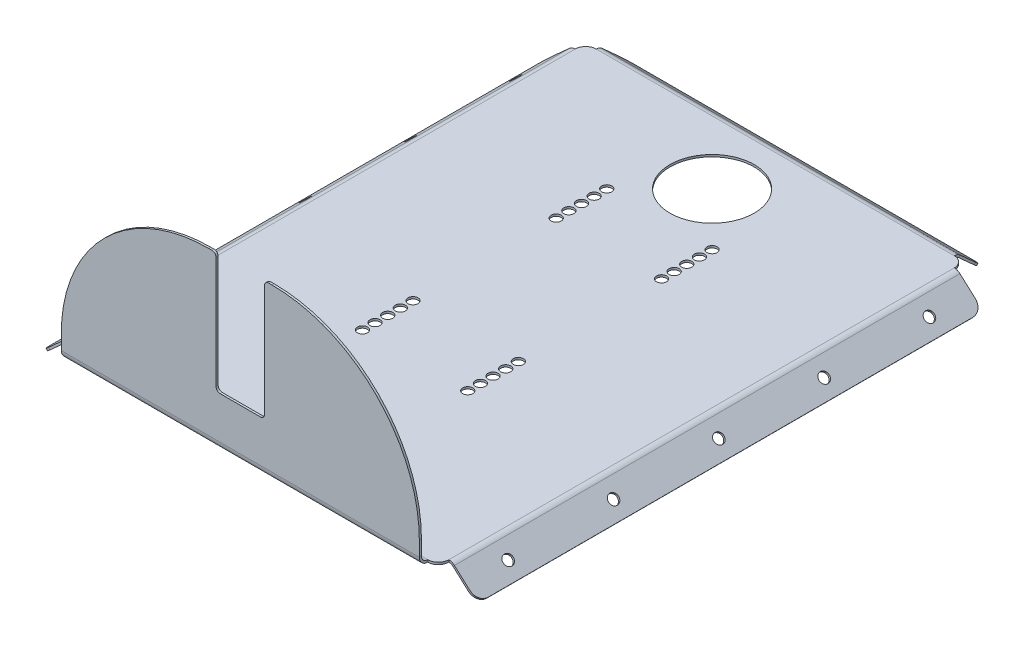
ISO-10303-21;
HEADER;
FILE_DESCRIPTION(('STEP AP214'),'2;1');
FILE_NAME('part.step','',(''),(''),'','','');
FILE_SCHEMA(('AUTOMOTIVE_DESIGN { 1 0 10303 214 1 1 1 1 }'));
ENDSEC;
DATA;
#1=APPLICATION_CONTEXT('core data for automotive mechanical design processes');
#2=APPLICATION_PROTOCOL_DEFINITION('international standard','automotive_design',2000,#1);
#3=PRODUCT_CONTEXT('',#1,'mechanical');
#4=PRODUCT('Part','Part','',(#3));
#5=PRODUCT_RELATED_PRODUCT_CATEGORY('part','',(#4));
#6=PRODUCT_DEFINITION_FORMATION('','',#4);
#7=PRODUCT_DEFINITION_CONTEXT('part definition',#1,'design');
#8=PRODUCT_DEFINITION('design','',#6,#7);
#9=PRODUCT_DEFINITION_SHAPE('','',#8);
#10=(LENGTH_UNIT() NAMED_UNIT(*) SI_UNIT(.MILLI.,.METRE.));
#11=(NAMED_UNIT(*) PLANE_ANGLE_UNIT() SI_UNIT($,.RADIAN.));
#12=(NAMED_UNIT(*) SI_UNIT($,.STERADIAN.) SOLID_ANGLE_UNIT());
#13=UNCERTAINTY_MEASURE_WITH_UNIT(LENGTH_MEASURE(1.E-05),#10,'distance_accuracy_value','');
#14=(GEOMETRIC_REPRESENTATION_CONTEXT(3) GLOBAL_UNCERTAINTY_ASSIGNED_CONTEXT((#13)) GLOBAL_UNIT_ASSIGNED_CONTEXT((#10,
#11,#12)) REPRESENTATION_CONTEXT('',''));
#15=CARTESIAN_POINT('',(0.,0.,0.));
#16=DIRECTION('',(0.,0.,1.));
#17=DIRECTION('',(1.,0.,0.));
#18=AXIS2_PLACEMENT_3D('',#15,#16,#17);
#19=CARTESIAN_POINT('',(-41.6196809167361,44.9443658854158,0.));
#20=DIRECTION('',(0.669130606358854,-0.743144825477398,0.));
#21=DIRECTION('',(0.743144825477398,0.669130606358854,0.));
#22=AXIS2_PLACEMENT_3D('',#19,#20,#21);
#23=PLANE('',#22);
#24=CARTESIAN_POINT('',(-98.2123597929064,-6.01191105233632,-50.));
#25=DIRECTION('',(0.669130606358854,-0.743144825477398,0.));
#26=DIRECTION('',(0.743144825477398,0.669130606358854,0.));
#27=AXIS2_PLACEMENT_3D('',#24,#25,#26);
#28=CIRCLE('',#27,2.4);
#29=CARTESIAN_POINT('',(-96.4288122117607,-4.40599759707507,-50.));
#30=VERTEX_POINT('',#29);
#31=EDGE_CURVE('E933',#30,#30,#28,.T.);
#32=ORIENTED_EDGE('',*,*,#31,.T.);
#33=EDGE_LOOP('',(#32));
#34=FACE_BOUND('',#33,.T.);
#35=CARTESIAN_POINT('',(-98.2123597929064,-6.0119110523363,100.));
#36=DIRECTION('',(0.669130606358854,-0.743144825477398,0.));
#37=DIRECTION('',(0.743144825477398,0.669130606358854,0.));
#38=AXIS2_PLACEMENT_3D('',#35,#36,#37);
#39=CIRCLE('',#38,2.4);
#40=CARTESIAN_POINT('',(-96.4288122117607,-4.40599759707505,100.));
#41=VERTEX_POINT('',#40);
#42=EDGE_CURVE('E921',#41,#41,#39,.T.);
#43=ORIENTED_EDGE('',*,*,#42,.T.);
#44=EDGE_LOOP('',(#43));
#45=FACE_BOUND('',#44,.T.);
#46=DIRECTION('',(0.,0.,1.));
#47=VECTOR('',#46,1.);
#48=CARTESIAN_POINT('',(-103.748197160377,-10.9964014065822,0.));
#49=LINE('',#48,#47);
#50=CARTESIAN_POINT('',(-103.748197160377,-10.9964014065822,-115.));
#51=VERTEX_POINT('',#50);
#52=CARTESIAN_POINT('',(-103.748197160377,-10.9964014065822,115.));
#53=VERTEX_POINT('',#52);
#54=EDGE_CURVE('E438',#51,#53,#49,.T.);
#55=ORIENTED_EDGE('',*,*,#54,.T.);
#56=CARTESIAN_POINT('',(-100.03247303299,-7.65074837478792,115.));
#57=DIRECTION('',(0.669130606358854,-0.743144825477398,0.));
#58=DIRECTION('',(0.743144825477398,0.669130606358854,0.));
#59=AXIS2_PLACEMENT_3D('',#56,#57,#58);
#60=CIRCLE('',#59,5.);
#61=CARTESIAN_POINT('',(-100.03247303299,-7.65074837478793,120.));
#62=VERTEX_POINT('',#61);
#63=EDGE_CURVE('E753',#53,#62,#60,.F.);
#64=ORIENTED_EDGE('',*,*,#63,.T.);
#65=DIRECTION('',(0.743144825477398,0.669130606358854,0.));
#66=VECTOR('',#65,1.);
#67=CARTESIAN_POINT('',(-41.6196809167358,44.9443658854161,120.));
#68=LINE('',#67,#66);
#69=CARTESIAN_POINT('',(-92.6765224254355,-1.02742069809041,120.));
#70=VERTEX_POINT('',#69);
#71=EDGE_CURVE('E435',#62,#70,#68,.T.);
#72=ORIENTED_EDGE('',*,*,#71,.T.);
#73=DIRECTION('',(0.,0.,-1.));
#74=VECTOR('',#73,1.);
#75=CARTESIAN_POINT('',(-92.6765224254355,-1.0274206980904,120.));
#76=LINE('',#75,#74);
#77=CARTESIAN_POINT('',(-92.6765224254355,-1.02742069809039,-120.));
#78=VERTEX_POINT('',#77);
#79=EDGE_CURVE('E452',#78,#70,#76,.F.);
#80=ORIENTED_EDGE('',*,*,#79,.F.);
#81=DIRECTION('',(-0.743144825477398,-0.669130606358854,0.));
#82=VECTOR('',#81,1.);
#83=CARTESIAN_POINT('',(-41.6196809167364,44.9443658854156,-120.));
#84=LINE('',#83,#82);
#85=CARTESIAN_POINT('',(-100.03247303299,-7.65074837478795,-120.));
#86=VERTEX_POINT('',#85);
#87=EDGE_CURVE('E441',#78,#86,#84,.T.);
#88=ORIENTED_EDGE('',*,*,#87,.T.);
#89=CARTESIAN_POINT('',(-100.03247303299,-7.65074837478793,-115.));
#90=DIRECTION('',(0.669130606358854,-0.743144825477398,0.));
#91=DIRECTION('',(0.743144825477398,0.669130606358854,0.));
#92=AXIS2_PLACEMENT_3D('',#89,#90,#91);
#93=CIRCLE('',#92,5.);
#94=EDGE_CURVE('E751',#86,#51,#93,.F.);
#95=ORIENTED_EDGE('',*,*,#94,.T.);
#96=EDGE_LOOP('',(#55,#64,#72,#80,#88,#95));
#97=FACE_BOUND('',#96,.T.);
#98=CARTESIAN_POINT('',(-98.2123597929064,-6.01191105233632,0.));
#99=DIRECTION('',(0.669130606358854,-0.743144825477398,0.));
#100=DIRECTION('',(0.743144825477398,0.669130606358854,0.));
#101=AXIS2_PLACEMENT_3D('',#98,#99,#100);
#102=CIRCLE('',#101,2.4);
#103=CARTESIAN_POINT('',(-96.4288122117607,-4.40599759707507,0.));
#104=VERTEX_POINT('',#103);
#105=EDGE_CURVE('E915',#104,#104,#102,.T.);
#106=ORIENTED_EDGE('',*,*,#105,.T.);
#107=EDGE_LOOP('',(#106));
#108=FACE_BOUND('',#107,.T.);
#109=CARTESIAN_POINT('',(-98.2123597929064,-6.01191105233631,50.));
#110=DIRECTION('',(0.669130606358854,-0.743144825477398,0.));
#111=DIRECTION('',(0.743144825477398,0.669130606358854,0.));
#112=AXIS2_PLACEMENT_3D('',#109,#110,#111);
#113=CIRCLE('',#112,2.4);
#114=CARTESIAN_POINT('',(-96.4288122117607,-4.40599759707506,50.));
#115=VERTEX_POINT('',#114);
#116=EDGE_CURVE('E927',#115,#115,#113,.T.);
#117=ORIENTED_EDGE('',*,*,#116,.T.);
#118=EDGE_LOOP('',(#117));
#119=FACE_BOUND('',#118,.T.);
#120=CARTESIAN_POINT('',(-98.2123597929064,-6.01191105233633,-100.));
#121=DIRECTION('',(0.669130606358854,-0.743144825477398,0.));
#122=DIRECTION('',(0.743144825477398,0.669130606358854,0.));
#123=AXIS2_PLACEMENT_3D('',#120,#121,#122);
#124=CIRCLE('',#123,2.4);
#125=CARTESIAN_POINT('',(-96.4288122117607,-4.40599759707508,-100.));
#126=VERTEX_POINT('',#125);
#127=EDGE_CURVE('E939',#126,#126,#124,.T.);
#128=ORIENTED_EDGE('',*,*,#127,.T.);
#129=EDGE_LOOP('',(#128));
#130=FACE_BOUND('',#129,.T.);
#131=ADVANCED_FACE('F115',(#34,#45,#97,#108,#119,#130),#23,.F.);
#132=CARTESIAN_POINT('',(-40.9505503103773,44.2012210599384,0.));
#133=DIRECTION('',(0.669130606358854,-0.743144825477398,0.));
#134=DIRECTION('',(0.743144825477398,0.669130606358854,0.));
#135=AXIS2_PLACEMENT_3D('',#132,#133,#134);
#136=PLANE('',#135);
#137=CARTESIAN_POINT('',(-97.5432291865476,-6.75505587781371,-50.));
#138=DIRECTION('',(0.669130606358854,-0.743144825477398,0.));
#139=DIRECTION('',(0.743144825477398,0.669130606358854,0.));
#140=AXIS2_PLACEMENT_3D('',#137,#138,#139);
#141=CIRCLE('',#140,2.4);
#142=CARTESIAN_POINT('',(-95.7596816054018,-5.14914242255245,-50.));
#143=VERTEX_POINT('',#142);
#144=EDGE_CURVE('E930',#143,#143,#141,.T.);
#145=ORIENTED_EDGE('',*,*,#144,.F.);
#146=EDGE_LOOP('',(#145));
#147=FACE_BOUND('',#146,.T.);
#148=CARTESIAN_POINT('',(-97.5432291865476,-6.75505587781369,100.));
#149=DIRECTION('',(0.669130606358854,-0.743144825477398,0.));
#150=DIRECTION('',(0.743144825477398,0.669130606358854,0.));
#151=AXIS2_PLACEMENT_3D('',#148,#149,#150);
#152=CIRCLE('',#151,2.4);
#153=CARTESIAN_POINT('',(-95.7596816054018,-5.14914242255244,100.));
#154=VERTEX_POINT('',#153);
#155=EDGE_CURVE('E918',#154,#154,#152,.T.);
#156=ORIENTED_EDGE('',*,*,#155,.F.);
#157=EDGE_LOOP('',(#156));
#158=FACE_BOUND('',#157,.T.);
#159=DIRECTION('',(-0.743144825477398,-0.669130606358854,0.));
#160=VECTOR('',#159,1.);
#161=CARTESIAN_POINT('',(-91.1515921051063,-0.999999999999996,120.));
#162=LINE('',#161,#160);
#163=CARTESIAN_POINT('',(-99.3633424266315,-8.39389320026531,120.));
#164=VERTEX_POINT('',#163);
#165=CARTESIAN_POINT('',(-92.0073918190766,-1.77056552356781,120.));
#166=VERTEX_POINT('',#165);
#167=EDGE_CURVE('E444',#164,#166,#162,.F.);
#168=ORIENTED_EDGE('',*,*,#167,.F.);
#169=CARTESIAN_POINT('',(-99.3633424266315,-8.39389320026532,115.));
#170=DIRECTION('',(0.669130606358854,-0.743144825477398,0.));
#171=DIRECTION('',(0.743144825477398,0.669130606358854,0.));
#172=AXIS2_PLACEMENT_3D('',#169,#170,#171);
#173=CIRCLE('',#172,5.);
#174=CARTESIAN_POINT('',(-103.079066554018,-11.7395462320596,115.));
#175=VERTEX_POINT('',#174);
#176=EDGE_CURVE('E744',#164,#175,#173,.T.);
#177=ORIENTED_EDGE('',*,*,#176,.T.);
#178=DIRECTION('',(0.,0.,-1.));
#179=VECTOR('',#178,1.);
#180=CARTESIAN_POINT('',(-103.079066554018,-11.7395462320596,120.));
#181=LINE('',#180,#179);
#182=CARTESIAN_POINT('',(-103.079066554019,-11.7395462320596,-115.));
#183=VERTEX_POINT('',#182);
#184=EDGE_CURVE('E446',#183,#175,#181,.F.);
#185=ORIENTED_EDGE('',*,*,#184,.F.);
#186=CARTESIAN_POINT('',(-99.3633424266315,-8.39389320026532,-115.));
#187=DIRECTION('',(0.669130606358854,-0.743144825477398,0.));
#188=DIRECTION('',(0.743144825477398,0.669130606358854,0.));
#189=AXIS2_PLACEMENT_3D('',#186,#187,#188);
#190=CIRCLE('',#189,5.);
#191=CARTESIAN_POINT('',(-99.3633424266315,-8.39389320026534,-120.));
#192=VERTEX_POINT('',#191);
#193=EDGE_CURVE('E742',#183,#192,#190,.T.);
#194=ORIENTED_EDGE('',*,*,#193,.T.);
#195=DIRECTION('',(0.743144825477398,0.669130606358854,0.));
#196=VECTOR('',#195,1.);
#197=CARTESIAN_POINT('',(-103.079066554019,-11.7395462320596,-120.));
#198=LINE('',#197,#196);
#199=CARTESIAN_POINT('',(-92.0073918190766,-1.77056552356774,-120.));
#200=VERTEX_POINT('',#199);
#201=EDGE_CURVE('E449',#200,#192,#198,.F.);
#202=ORIENTED_EDGE('',*,*,#201,.F.);
#203=DIRECTION('',(0.,0.,-1.));
#204=VECTOR('',#203,1.);
#205=CARTESIAN_POINT('',(-92.0073918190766,-1.77056552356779,120.));
#206=LINE('',#205,#204);
#207=EDGE_CURVE('E458',#166,#200,#206,.T.);
#208=ORIENTED_EDGE('',*,*,#207,.F.);
#209=EDGE_LOOP('',(#168,#177,#185,#194,#202,#208));
#210=FACE_BOUND('',#209,.T.);
#211=CARTESIAN_POINT('',(-97.5432291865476,-6.75505587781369,0.));
#212=DIRECTION('',(0.669130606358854,-0.743144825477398,0.));
#213=DIRECTION('',(0.743144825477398,0.669130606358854,0.));
#214=AXIS2_PLACEMENT_3D('',#211,#212,#213);
#215=CIRCLE('',#214,2.4);
#216=CARTESIAN_POINT('',(-95.7596816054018,-5.14914242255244,0.));
#217=VERTEX_POINT('',#216);
#218=EDGE_CURVE('E910',#217,#217,#215,.T.);
#219=ORIENTED_EDGE('',*,*,#218,.F.);
#220=EDGE_LOOP('',(#219));
#221=FACE_BOUND('',#220,.T.);
#222=CARTESIAN_POINT('',(-97.5432291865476,-6.75505587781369,50.));
#223=DIRECTION('',(0.669130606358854,-0.743144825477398,0.));
#224=DIRECTION('',(0.743144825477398,0.669130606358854,0.));
#225=AXIS2_PLACEMENT_3D('',#222,#223,#224);
#226=CIRCLE('',#225,2.4);
#227=CARTESIAN_POINT('',(-95.7596816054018,-5.14914242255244,50.));
#228=VERTEX_POINT('',#227);
#229=EDGE_CURVE('E924',#228,#228,#226,.T.);
#230=ORIENTED_EDGE('',*,*,#229,.F.);
#231=EDGE_LOOP('',(#230));
#232=FACE_BOUND('',#231,.T.);
#233=CARTESIAN_POINT('',(-97.5432291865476,-6.75505587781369,-100.));
#234=DIRECTION('',(0.669130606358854,-0.743144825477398,0.));
#235=DIRECTION('',(0.743144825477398,0.669130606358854,0.));
#236=AXIS2_PLACEMENT_3D('',#233,#234,#235);
#237=CIRCLE('',#236,2.4);
#238=CARTESIAN_POINT('',(-95.7596816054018,-5.14914242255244,-100.));
#239=VERTEX_POINT('',#238);
#240=EDGE_CURVE('E936',#239,#239,#237,.T.);
#241=ORIENTED_EDGE('',*,*,#240,.F.);
#242=EDGE_LOOP('',(#241));
#243=FACE_BOUND('',#242,.T.);
#244=ADVANCED_FACE('F956',(#147,#158,#210,#221,#232,#243),#136,.T.);
#245=CARTESIAN_POINT('',(-85.,80.,129.));
#246=DIRECTION('',(0.,-1.,0.));
#247=DIRECTION('',(0.,0.,-1.));
#248=AXIS2_PLACEMENT_3D('',#245,#246,#247);
#249=PLANE('',#248);
#250=DIRECTION('',(1.,0.,0.));
#251=VECTOR('',#250,1.);
#252=CARTESIAN_POINT('',(-85.,80.,128.));
#253=LINE('',#252,#251);
#254=CARTESIAN_POINT('',(14.9999999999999,80.,128.));
#255=VERTEX_POINT('',#254);
#256=CARTESIAN_POINT('',(13.5,80.,128.));
#257=VERTEX_POINT('',#256);
#258=EDGE_CURVE('E415',#255,#257,#253,.F.);
#259=ORIENTED_EDGE('',*,*,#258,.T.);
#260=DIRECTION('',(0.,0.,1.));
#261=VECTOR('',#260,1.);
#262=CARTESIAN_POINT('',(13.5,80.,129.));
#263=LINE('',#262,#261);
#264=CARTESIAN_POINT('',(13.5,80.,129.));
#265=VERTEX_POINT('',#264);
#266=EDGE_CURVE('E829',#257,#265,#263,.T.);
#267=ORIENTED_EDGE('',*,*,#266,.T.);
#268=DIRECTION('',(-1.,0.,0.));
#269=VECTOR('',#268,1.);
#270=CARTESIAN_POINT('',(0.,80.,129.));
#271=LINE('',#270,#269);
#272=CARTESIAN_POINT('',(14.9999999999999,80.,129.));
#273=VERTEX_POINT('',#272);
#274=EDGE_CURVE('E413',#273,#265,#271,.T.);
#275=ORIENTED_EDGE('',*,*,#274,.F.);
#276=DIRECTION('',(0.,0.,-1.));
#277=VECTOR('',#276,1.);
#278=CARTESIAN_POINT('',(14.9999999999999,80.,129.));
#279=LINE('',#278,#277);
#280=EDGE_CURVE('E801',#273,#255,#279,.T.);
#281=ORIENTED_EDGE('',*,*,#280,.T.);
#282=EDGE_LOOP('',(#259,#267,#275,#281));
#283=FACE_BOUND('',#282,.T.);
#284=ADVANCED_FACE('F962',(#283),#249,.F.);
#285=CARTESIAN_POINT('',(0.,-1.,0.));
#286=DIRECTION('',(0.,1.,0.));
#287=DIRECTION('',(0.,0.,1.));
#288=AXIS2_PLACEMENT_3D('',#285,#286,#287);
#289=PLANE('',#288);
#290=CARTESIAN_POINT('',(0.,-0.999999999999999,-95.0000000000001));
#291=DIRECTION('',(0.,1.,0.));
#292=DIRECTION('',(0.,0.,1.));
#293=AXIS2_PLACEMENT_3D('',#290,#291,#292);
#294=CIRCLE('',#293,20.);
#295=CARTESIAN_POINT('',(0.,-0.999999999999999,-75.0000000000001));
#296=VERTEX_POINT('',#295);
#297=EDGE_CURVE('E554',#296,#296,#294,.T.);
#298=ORIENTED_EDGE('',*,*,#297,.T.);
#299=EDGE_LOOP('',(#298));
#300=FACE_BOUND('',#299,.T.);
#301=CARTESIAN_POINT('',(25.,-0.999999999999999,-70.));
#302=DIRECTION('',(0.,1.,0.));
#303=DIRECTION('',(0.,0.,1.));
#304=AXIS2_PLACEMENT_3D('',#301,#302,#303);
#305=CIRCLE('',#304,2.4);
#306=CARTESIAN_POINT('',(25.,-0.999999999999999,-67.6));
#307=VERTEX_POINT('',#306);
#308=EDGE_CURVE('E560',#307,#307,#305,.T.);
#309=ORIENTED_EDGE('',*,*,#308,.T.);
#310=EDGE_LOOP('',(#309));
#311=FACE_BOUND('',#310,.T.);
#312=CARTESIAN_POINT('',(-25.,-0.999999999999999,-70.));
#313=DIRECTION('',(0.,1.,0.));
#314=DIRECTION('',(0.,0.,1.));
#315=AXIS2_PLACEMENT_3D('',#312,#313,#314);
#316=CIRCLE('',#315,2.4);
#317=CARTESIAN_POINT('',(-25.,-0.999999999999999,-67.6));
#318=VERTEX_POINT('',#317);
#319=EDGE_CURVE('E566',#318,#318,#316,.T.);
#320=ORIENTED_EDGE('',*,*,#319,.T.);
#321=EDGE_LOOP('',(#320));
#322=FACE_BOUND('',#321,.T.);
#323=CARTESIAN_POINT('',(25.,-0.999999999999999,22.));
#324=DIRECTION('',(0.,1.,0.));
#325=DIRECTION('',(0.,0.,1.));
#326=AXIS2_PLACEMENT_3D('',#323,#324,#325);
#327=CIRCLE('',#326,2.4);
#328=CARTESIAN_POINT('',(25.,-0.999999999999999,24.4));
#329=VERTEX_POINT('',#328);
#330=EDGE_CURVE('E572',#329,#329,#327,.T.);
#331=ORIENTED_EDGE('',*,*,#330,.T.);
#332=EDGE_LOOP('',(#331));
#333=FACE_BOUND('',#332,.T.);
#334=CARTESIAN_POINT('',(-25.,-0.999999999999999,22.));
#335=DIRECTION('',(0.,1.,0.));
#336=DIRECTION('',(0.,0.,1.));
#337=AXIS2_PLACEMENT_3D('',#334,#335,#336);
#338=CIRCLE('',#337,2.4);
#339=CARTESIAN_POINT('',(-25.,-0.999999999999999,24.4));
#340=VERTEX_POINT('',#339);
#341=EDGE_CURVE('E578',#340,#340,#338,.T.);
#342=ORIENTED_EDGE('',*,*,#341,.T.);
#343=EDGE_LOOP('',(#342));
#344=FACE_BOUND('',#343,.T.);
#345=CARTESIAN_POINT('',(25.,-0.999999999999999,-64.));
#346=DIRECTION('',(0.,1.,0.));
#347=DIRECTION('',(0.,0.,1.));
#348=AXIS2_PLACEMENT_3D('',#345,#346,#347);
#349=CIRCLE('',#348,2.4);
#350=CARTESIAN_POINT('',(25.,-0.999999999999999,-61.6));
#351=VERTEX_POINT('',#350);
#352=EDGE_CURVE('E584',#351,#351,#349,.T.);
#353=ORIENTED_EDGE('',*,*,#352,.T.);
#354=EDGE_LOOP('',(#353));
#355=FACE_BOUND('',#354,.T.);
#356=CARTESIAN_POINT('',(-25.,-0.999999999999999,-64.));
#357=DIRECTION('',(0.,1.,0.));
#358=DIRECTION('',(0.,0.,1.));
#359=AXIS2_PLACEMENT_3D('',#356,#357,#358);
#360=CIRCLE('',#359,2.4);
#361=CARTESIAN_POINT('',(-25.,-0.999999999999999,-61.6));
#362=VERTEX_POINT('',#361);
#363=EDGE_CURVE('E590',#362,#362,#360,.T.);
#364=ORIENTED_EDGE('',*,*,#363,.T.);
#365=EDGE_LOOP('',(#364));
#366=FACE_BOUND('',#365,.T.);
#367=CARTESIAN_POINT('',(25.,-0.999999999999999,28.));
#368=DIRECTION('',(0.,1.,0.));
#369=DIRECTION('',(0.,0.,1.));
#370=AXIS2_PLACEMENT_3D('',#367,#368,#369);
#371=CIRCLE('',#370,2.4);
#372=CARTESIAN_POINT('',(25.,-0.999999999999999,30.4));
#373=VERTEX_POINT('',#372);
#374=EDGE_CURVE('E596',#373,#373,#371,.T.);
#375=ORIENTED_EDGE('',*,*,#374,.T.);
#376=EDGE_LOOP('',(#375));
#377=FACE_BOUND('',#376,.T.);
#378=CARTESIAN_POINT('',(-25.,-0.999999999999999,28.));
#379=DIRECTION('',(0.,1.,0.));
#380=DIRECTION('',(0.,0.,1.));
#381=AXIS2_PLACEMENT_3D('',#378,#379,#380);
#382=CIRCLE('',#381,2.4);
#383=CARTESIAN_POINT('',(-25.,-0.999999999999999,30.4));
#384=VERTEX_POINT('',#383);
#385=EDGE_CURVE('E602',#384,#384,#382,.T.);
#386=ORIENTED_EDGE('',*,*,#385,.T.);
#387=EDGE_LOOP('',(#386));
#388=FACE_BOUND('',#387,.T.);
#389=CARTESIAN_POINT('',(25.,-0.999999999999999,-58.));
#390=DIRECTION('',(0.,1.,0.));
#391=DIRECTION('',(0.,0.,1.));
#392=AXIS2_PLACEMENT_3D('',#389,#390,#391);
#393=CIRCLE('',#392,2.4);
#394=CARTESIAN_POINT('',(25.,-0.999999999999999,-55.6));
#395=VERTEX_POINT('',#394);
#396=EDGE_CURVE('E608',#395,#395,#393,.T.);
#397=ORIENTED_EDGE('',*,*,#396,.T.);
#398=EDGE_LOOP('',(#397));
#399=FACE_BOUND('',#398,.T.);
#400=CARTESIAN_POINT('',(25.,-0.999999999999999,-46.));
#401=DIRECTION('',(0.,1.,0.));
#402=DIRECTION('',(0.,0.,1.));
#403=AXIS2_PLACEMENT_3D('',#400,#401,#402);
#404=CIRCLE('',#403,2.4);
#405=CARTESIAN_POINT('',(25.,-0.999999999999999,-43.6));
#406=VERTEX_POINT('',#405);
#407=EDGE_CURVE('E614',#406,#406,#404,.T.);
#408=ORIENTED_EDGE('',*,*,#407,.T.);
#409=EDGE_LOOP('',(#408));
#410=FACE_BOUND('',#409,.T.);
#411=CARTESIAN_POINT('',(-25.,-0.999999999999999,-46.));
#412=DIRECTION('',(0.,1.,0.));
#413=DIRECTION('',(0.,0.,1.));
#414=AXIS2_PLACEMENT_3D('',#411,#412,#413);
#415=CIRCLE('',#414,2.4);
#416=CARTESIAN_POINT('',(-25.,-0.999999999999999,-43.6));
#417=VERTEX_POINT('',#416);
#418=EDGE_CURVE('E620',#417,#417,#415,.T.);
#419=ORIENTED_EDGE('',*,*,#418,.T.);
#420=EDGE_LOOP('',(#419));
#421=FACE_BOUND('',#420,.T.);
#422=CARTESIAN_POINT('',(25.,-0.999999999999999,46.));
#423=DIRECTION('',(0.,1.,0.));
#424=DIRECTION('',(0.,0.,1.));
#425=AXIS2_PLACEMENT_3D('',#422,#423,#424);
#426=CIRCLE('',#425,2.4);
#427=CARTESIAN_POINT('',(25.,-0.999999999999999,48.4));
#428=VERTEX_POINT('',#427);
#429=EDGE_CURVE('E626',#428,#428,#426,.T.);
#430=ORIENTED_EDGE('',*,*,#429,.T.);
#431=EDGE_LOOP('',(#430));
#432=FACE_BOUND('',#431,.T.);
#433=CARTESIAN_POINT('',(-25.,-0.999999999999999,46.));
#434=DIRECTION('',(0.,1.,0.));
#435=DIRECTION('',(0.,0.,1.));
#436=AXIS2_PLACEMENT_3D('',#433,#434,#435);
#437=CIRCLE('',#436,2.4);
#438=CARTESIAN_POINT('',(-25.,-0.999999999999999,48.4));
#439=VERTEX_POINT('',#438);
#440=EDGE_CURVE('E632',#439,#439,#437,.T.);
#441=ORIENTED_EDGE('',*,*,#440,.T.);
#442=EDGE_LOOP('',(#441));
#443=FACE_BOUND('',#442,.T.);
#444=CARTESIAN_POINT('',(-25.,-0.999999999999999,-58.));
#445=DIRECTION('',(0.,1.,0.));
#446=DIRECTION('',(0.,0.,1.));
#447=AXIS2_PLACEMENT_3D('',#444,#445,#446);
#448=CIRCLE('',#447,2.4);
#449=CARTESIAN_POINT('',(-25.,-0.999999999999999,-55.6));
#450=VERTEX_POINT('',#449);
#451=EDGE_CURVE('E638',#450,#450,#448,.T.);
#452=ORIENTED_EDGE('',*,*,#451,.T.);
#453=EDGE_LOOP('',(#452));
#454=FACE_BOUND('',#453,.T.);
#455=CARTESIAN_POINT('',(25.,-0.999999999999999,34.));
#456=DIRECTION('',(0.,1.,0.));
#457=DIRECTION('',(0.,0.,1.));
#458=AXIS2_PLACEMENT_3D('',#455,#456,#457);
#459=CIRCLE('',#458,2.4);
#460=CARTESIAN_POINT('',(25.,-0.999999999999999,36.4));
#461=VERTEX_POINT('',#460);
#462=EDGE_CURVE('E644',#461,#461,#459,.T.);
#463=ORIENTED_EDGE('',*,*,#462,.T.);
#464=EDGE_LOOP('',(#463));
#465=FACE_BOUND('',#464,.T.);
#466=CARTESIAN_POINT('',(-25.,-0.999999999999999,34.));
#467=DIRECTION('',(0.,1.,0.));
#468=DIRECTION('',(0.,0.,1.));
#469=AXIS2_PLACEMENT_3D('',#466,#467,#468);
#470=CIRCLE('',#469,2.4);
#471=CARTESIAN_POINT('',(-25.,-0.999999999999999,36.4));
#472=VERTEX_POINT('',#471);
#473=EDGE_CURVE('E650',#472,#472,#470,.T.);
#474=ORIENTED_EDGE('',*,*,#473,.T.);
#475=EDGE_LOOP('',(#474));
#476=FACE_BOUND('',#475,.T.);
#477=CARTESIAN_POINT('',(25.,-0.999999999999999,-52.));
#478=DIRECTION('',(0.,1.,0.));
#479=DIRECTION('',(0.,0.,1.));
#480=AXIS2_PLACEMENT_3D('',#477,#478,#479);
#481=CIRCLE('',#480,2.4);
#482=CARTESIAN_POINT('',(25.,-0.999999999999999,-49.6));
#483=VERTEX_POINT('',#482);
#484=EDGE_CURVE('E656',#483,#483,#481,.T.);
#485=ORIENTED_EDGE('',*,*,#484,.T.);
#486=EDGE_LOOP('',(#485));
#487=FACE_BOUND('',#486,.T.);
#488=CARTESIAN_POINT('',(-25.,-0.999999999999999,-52.));
#489=DIRECTION('',(0.,1.,0.));
#490=DIRECTION('',(0.,0.,1.));
#491=AXIS2_PLACEMENT_3D('',#488,#489,#490);
#492=CIRCLE('',#491,2.4);
#493=CARTESIAN_POINT('',(-25.,-0.999999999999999,-49.6));
#494=VERTEX_POINT('',#493);
#495=EDGE_CURVE('E662',#494,#494,#492,.T.);
#496=ORIENTED_EDGE('',*,*,#495,.T.);
#497=EDGE_LOOP('',(#496));
#498=FACE_BOUND('',#497,.T.);
#499=CARTESIAN_POINT('',(25.,-0.999999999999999,40.));
#500=DIRECTION('',(0.,1.,0.));
#501=DIRECTION('',(0.,0.,1.));
#502=AXIS2_PLACEMENT_3D('',#499,#500,#501);
#503=CIRCLE('',#502,2.4);
#504=CARTESIAN_POINT('',(25.,-0.999999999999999,42.4));
#505=VERTEX_POINT('',#504);
#506=EDGE_CURVE('E668',#505,#505,#503,.T.);
#507=ORIENTED_EDGE('',*,*,#506,.T.);
#508=EDGE_LOOP('',(#507));
#509=FACE_BOUND('',#508,.T.);
#510=CARTESIAN_POINT('',(-25.,-0.999999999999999,40.));
#511=DIRECTION('',(0.,1.,0.));
#512=DIRECTION('',(0.,0.,1.));
#513=AXIS2_PLACEMENT_3D('',#510,#511,#512);
#514=CIRCLE('',#513,2.4);
#515=CARTESIAN_POINT('',(-25.,-0.999999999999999,42.4));
#516=VERTEX_POINT('',#515);
#517=EDGE_CURVE('E674',#516,#516,#514,.T.);
#518=ORIENTED_EDGE('',*,*,#517,.T.);
#519=EDGE_LOOP('',(#518));
#520=FACE_BOUND('',#519,.T.);
#521=DIRECTION('',(-1.,0.,0.));
#522=VECTOR('',#521,1.);
#523=CARTESIAN_POINT('',(-90.,-1.,-125.));
#524=LINE('',#523,#522);
#525=CARTESIAN_POINT('',(84.9999999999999,-0.999999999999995,-125.));
#526=VERTEX_POINT('',#525);
#527=CARTESIAN_POINT('',(-85.,-0.999999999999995,-125.));
#528=VERTEX_POINT('',#527);
#529=EDGE_CURVE('E680',#526,#528,#524,.T.);
#530=ORIENTED_EDGE('',*,*,#529,.F.);
#531=CARTESIAN_POINT('',(84.9999999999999,-1.,-120.));
#532=DIRECTION('',(0.,1.,0.));
#533=DIRECTION('',(0.,0.,1.));
#534=AXIS2_PLACEMENT_3D('',#531,#532,#533);
#535=CIRCLE('',#534,5.);
#536=CARTESIAN_POINT('',(90.,-1.00000000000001,-120.));
#537=VERTEX_POINT('',#536);
#538=EDGE_CURVE('E726',#526,#537,#535,.F.);
#539=ORIENTED_EDGE('',*,*,#538,.T.);
#540=DIRECTION('',(0.,0.,-1.));
#541=VECTOR('',#540,1.);
#542=CARTESIAN_POINT('',(89.9999999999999,-1.,-125.));
#543=LINE('',#542,#541);
#544=CARTESIAN_POINT('',(90.,-1.00000000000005,120.));
#545=VERTEX_POINT('',#544);
#546=EDGE_CURVE('E678',#545,#537,#543,.T.);
#547=ORIENTED_EDGE('',*,*,#546,.F.);
#548=CARTESIAN_POINT('',(85.,-1.,120.));
#549=DIRECTION('',(0.,1.,0.));
#550=DIRECTION('',(0.,0.,1.));
#551=AXIS2_PLACEMENT_3D('',#548,#549,#550);
#552=CIRCLE('',#551,5.);
#553=CARTESIAN_POINT('',(84.9999999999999,-1.00000000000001,125.));
#554=VERTEX_POINT('',#553);
#555=EDGE_CURVE('E717',#545,#554,#552,.F.);
#556=ORIENTED_EDGE('',*,*,#555,.T.);
#557=DIRECTION('',(1.,0.,0.));
#558=VECTOR('',#557,1.);
#559=CARTESIAN_POINT('',(-90.,-1.,125.));
#560=LINE('',#559,#558);
#561=CARTESIAN_POINT('',(-85.,-1.,125.));
#562=VERTEX_POINT('',#561);
#563=EDGE_CURVE('E381',#562,#554,#560,.T.);
#564=ORIENTED_EDGE('',*,*,#563,.F.);
#565=CARTESIAN_POINT('',(-85.,-1.,120.));
#566=DIRECTION('',(0.,1.,0.));
#567=DIRECTION('',(0.,0.,1.));
#568=AXIS2_PLACEMENT_3D('',#565,#566,#567);
#569=CIRCLE('',#568,5.);
#570=CARTESIAN_POINT('',(-90.,-0.999999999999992,120.));
#571=VERTEX_POINT('',#570);
#572=EDGE_CURVE('E720',#562,#571,#569,.F.);
#573=ORIENTED_EDGE('',*,*,#572,.T.);
#574=DIRECTION('',(0.,0.,1.));
#575=VECTOR('',#574,1.);
#576=CARTESIAN_POINT('',(-90.,-1.,-125.));
#577=LINE('',#576,#575);
#578=CARTESIAN_POINT('',(-90.,-0.999999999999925,-120.));
#579=VERTEX_POINT('',#578);
#580=EDGE_CURVE('E683',#579,#571,#577,.T.);
#581=ORIENTED_EDGE('',*,*,#580,.F.);
#582=CARTESIAN_POINT('',(-85.,-1.,-120.));
#583=DIRECTION('',(0.,1.,0.));
#584=DIRECTION('',(0.,0.,1.));
#585=AXIS2_PLACEMENT_3D('',#582,#583,#584);
#586=CIRCLE('',#585,5.);
#587=EDGE_CURVE('E723',#579,#528,#586,.F.);
#588=ORIENTED_EDGE('',*,*,#587,.T.);
#589=EDGE_LOOP('',(#530,#539,#547,#556,#564,#573,#581,#588));
#590=FACE_BOUND('',#589,.T.);
#591=ADVANCED_FACE('F1157',(#300,#311,#322,#333,#344,#355,#366,#377,#388,#399,#410,#421,#432,
#443,#454,#465,#476,#487,#498,#509,#520,#590),#289,.F.);
#592=CARTESIAN_POINT('',(0.,0.,0.));
#593=DIRECTION('',(0.,1.,0.));
#594=DIRECTION('',(0.,0.,1.));
#595=AXIS2_PLACEMENT_3D('',#592,#593,#594);
#596=PLANE('',#595);
#597=CARTESIAN_POINT('',(0.,0.,-95.0000000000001));
#598=DIRECTION('',(0.,1.,0.));
#599=DIRECTION('',(0.,0.,1.));
#600=AXIS2_PLACEMENT_3D('',#597,#598,#599);
#601=CIRCLE('',#600,20.);
#602=CARTESIAN_POINT('',(0.,0.,-75.0000000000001));
#603=VERTEX_POINT('',#602);
#604=EDGE_CURVE('E543',#603,#603,#601,.T.);
#605=ORIENTED_EDGE('',*,*,#604,.F.);
#606=EDGE_LOOP('',(#605));
#607=FACE_BOUND('',#606,.T.);
#608=CARTESIAN_POINT('',(25.,0.,-70.));
#609=DIRECTION('',(0.,1.,0.));
#610=DIRECTION('',(0.,0.,1.));
#611=AXIS2_PLACEMENT_3D('',#608,#609,#610);
#612=CIRCLE('',#611,2.4);
#613=CARTESIAN_POINT('',(25.,0.,-67.6));
#614=VERTEX_POINT('',#613);
#615=EDGE_CURVE('E557',#614,#614,#612,.T.);
#616=ORIENTED_EDGE('',*,*,#615,.F.);
#617=EDGE_LOOP('',(#616));
#618=FACE_BOUND('',#617,.T.);
#619=CARTESIAN_POINT('',(-25.,0.,-70.));
#620=DIRECTION('',(0.,1.,0.));
#621=DIRECTION('',(0.,0.,1.));
#622=AXIS2_PLACEMENT_3D('',#619,#620,#621);
#623=CIRCLE('',#622,2.4);
#624=CARTESIAN_POINT('',(-25.,0.,-67.6));
#625=VERTEX_POINT('',#624);
#626=EDGE_CURVE('E563',#625,#625,#623,.T.);
#627=ORIENTED_EDGE('',*,*,#626,.F.);
#628=EDGE_LOOP('',(#627));
#629=FACE_BOUND('',#628,.T.);
#630=CARTESIAN_POINT('',(25.,0.,22.));
#631=DIRECTION('',(0.,1.,0.));
#632=DIRECTION('',(0.,0.,1.));
#633=AXIS2_PLACEMENT_3D('',#630,#631,#632);
#634=CIRCLE('',#633,2.4);
#635=CARTESIAN_POINT('',(25.,0.,24.4));
#636=VERTEX_POINT('',#635);
#637=EDGE_CURVE('E569',#636,#636,#634,.T.);
#638=ORIENTED_EDGE('',*,*,#637,.F.);
#639=EDGE_LOOP('',(#638));
#640=FACE_BOUND('',#639,.T.);
#641=CARTESIAN_POINT('',(-25.,0.,22.));
#642=DIRECTION('',(0.,1.,0.));
#643=DIRECTION('',(0.,0.,1.));
#644=AXIS2_PLACEMENT_3D('',#641,#642,#643);
#645=CIRCLE('',#644,2.4);
#646=CARTESIAN_POINT('',(-25.,0.,24.4));
#647=VERTEX_POINT('',#646);
#648=EDGE_CURVE('E575',#647,#647,#645,.T.);
#649=ORIENTED_EDGE('',*,*,#648,.F.);
#650=EDGE_LOOP('',(#649));
#651=FACE_BOUND('',#650,.T.);
#652=CARTESIAN_POINT('',(25.,0.,-64.));
#653=DIRECTION('',(0.,1.,0.));
#654=DIRECTION('',(0.,0.,1.));
#655=AXIS2_PLACEMENT_3D('',#652,#653,#654);
#656=CIRCLE('',#655,2.4);
#657=CARTESIAN_POINT('',(25.,0.,-61.6));
#658=VERTEX_POINT('',#657);
#659=EDGE_CURVE('E581',#658,#658,#656,.T.);
#660=ORIENTED_EDGE('',*,*,#659,.F.);
#661=EDGE_LOOP('',(#660));
#662=FACE_BOUND('',#661,.T.);
#663=CARTESIAN_POINT('',(-25.,0.,-64.));
#664=DIRECTION('',(0.,1.,0.));
#665=DIRECTION('',(0.,0.,1.));
#666=AXIS2_PLACEMENT_3D('',#663,#664,#665);
#667=CIRCLE('',#666,2.4);
#668=CARTESIAN_POINT('',(-25.,0.,-61.6));
#669=VERTEX_POINT('',#668);
#670=EDGE_CURVE('E587',#669,#669,#667,.T.);
#671=ORIENTED_EDGE('',*,*,#670,.F.);
#672=EDGE_LOOP('',(#671));
#673=FACE_BOUND('',#672,.T.);
#674=CARTESIAN_POINT('',(25.,0.,28.));
#675=DIRECTION('',(0.,1.,0.));
#676=DIRECTION('',(0.,0.,1.));
#677=AXIS2_PLACEMENT_3D('',#674,#675,#676);
#678=CIRCLE('',#677,2.4);
#679=CARTESIAN_POINT('',(25.,0.,30.4));
#680=VERTEX_POINT('',#679);
#681=EDGE_CURVE('E593',#680,#680,#678,.T.);
#682=ORIENTED_EDGE('',*,*,#681,.F.);
#683=EDGE_LOOP('',(#682));
#684=FACE_BOUND('',#683,.T.);
#685=CARTESIAN_POINT('',(-25.,0.,28.));
#686=DIRECTION('',(0.,1.,0.));
#687=DIRECTION('',(0.,0.,1.));
#688=AXIS2_PLACEMENT_3D('',#685,#686,#687);
#689=CIRCLE('',#688,2.4);
#690=CARTESIAN_POINT('',(-25.,0.,30.4));
#691=VERTEX_POINT('',#690);
#692=EDGE_CURVE('E599',#691,#691,#689,.T.);
#693=ORIENTED_EDGE('',*,*,#692,.F.);
#694=EDGE_LOOP('',(#693));
#695=FACE_BOUND('',#694,.T.);
#696=CARTESIAN_POINT('',(25.,0.,-58.));
#697=DIRECTION('',(0.,1.,0.));
#698=DIRECTION('',(0.,0.,1.));
#699=AXIS2_PLACEMENT_3D('',#696,#697,#698);
#700=CIRCLE('',#699,2.4);
#701=CARTESIAN_POINT('',(25.,0.,-55.6));
#702=VERTEX_POINT('',#701);
#703=EDGE_CURVE('E605',#702,#702,#700,.T.);
#704=ORIENTED_EDGE('',*,*,#703,.F.);
#705=EDGE_LOOP('',(#704));
#706=FACE_BOUND('',#705,.T.);
#707=CARTESIAN_POINT('',(25.,0.,-46.));
#708=DIRECTION('',(0.,1.,0.));
#709=DIRECTION('',(0.,0.,1.));
#710=AXIS2_PLACEMENT_3D('',#707,#708,#709);
#711=CIRCLE('',#710,2.4);
#712=CARTESIAN_POINT('',(25.,0.,-43.6));
#713=VERTEX_POINT('',#712);
#714=EDGE_CURVE('E611',#713,#713,#711,.T.);
#715=ORIENTED_EDGE('',*,*,#714,.F.);
#716=EDGE_LOOP('',(#715));
#717=FACE_BOUND('',#716,.T.);
#718=CARTESIAN_POINT('',(-25.,0.,-46.));
#719=DIRECTION('',(0.,1.,0.));
#720=DIRECTION('',(0.,0.,1.));
#721=AXIS2_PLACEMENT_3D('',#718,#719,#720);
#722=CIRCLE('',#721,2.4);
#723=CARTESIAN_POINT('',(-25.,0.,-43.6));
#724=VERTEX_POINT('',#723);
#725=EDGE_CURVE('E617',#724,#724,#722,.T.);
#726=ORIENTED_EDGE('',*,*,#725,.F.);
#727=EDGE_LOOP('',(#726));
#728=FACE_BOUND('',#727,.T.);
#729=CARTESIAN_POINT('',(25.,0.,46.));
#730=DIRECTION('',(0.,1.,0.));
#731=DIRECTION('',(0.,0.,1.));
#732=AXIS2_PLACEMENT_3D('',#729,#730,#731);
#733=CIRCLE('',#732,2.4);
#734=CARTESIAN_POINT('',(25.,0.,48.4));
#735=VERTEX_POINT('',#734);
#736=EDGE_CURVE('E623',#735,#735,#733,.T.);
#737=ORIENTED_EDGE('',*,*,#736,.F.);
#738=EDGE_LOOP('',(#737));
#739=FACE_BOUND('',#738,.T.);
#740=CARTESIAN_POINT('',(-25.,0.,46.));
#741=DIRECTION('',(0.,1.,0.));
#742=DIRECTION('',(0.,0.,1.));
#743=AXIS2_PLACEMENT_3D('',#740,#741,#742);
#744=CIRCLE('',#743,2.4);
#745=CARTESIAN_POINT('',(-25.,0.,48.4));
#746=VERTEX_POINT('',#745);
#747=EDGE_CURVE('E629',#746,#746,#744,.T.);
#748=ORIENTED_EDGE('',*,*,#747,.F.);
#749=EDGE_LOOP('',(#748));
#750=FACE_BOUND('',#749,.T.);
#751=CARTESIAN_POINT('',(-25.,0.,-58.));
#752=DIRECTION('',(0.,1.,0.));
#753=DIRECTION('',(0.,0.,1.));
#754=AXIS2_PLACEMENT_3D('',#751,#752,#753);
#755=CIRCLE('',#754,2.4);
#756=CARTESIAN_POINT('',(-25.,0.,-55.6));
#757=VERTEX_POINT('',#756);
#758=EDGE_CURVE('E635',#757,#757,#755,.T.);
#759=ORIENTED_EDGE('',*,*,#758,.F.);
#760=EDGE_LOOP('',(#759));
#761=FACE_BOUND('',#760,.T.);
#762=CARTESIAN_POINT('',(25.,0.,34.));
#763=DIRECTION('',(0.,1.,0.));
#764=DIRECTION('',(0.,0.,1.));
#765=AXIS2_PLACEMENT_3D('',#762,#763,#764);
#766=CIRCLE('',#765,2.4);
#767=CARTESIAN_POINT('',(25.,0.,36.4));
#768=VERTEX_POINT('',#767);
#769=EDGE_CURVE('E641',#768,#768,#766,.T.);
#770=ORIENTED_EDGE('',*,*,#769,.F.);
#771=EDGE_LOOP('',(#770));
#772=FACE_BOUND('',#771,.T.);
#773=CARTESIAN_POINT('',(-25.,0.,34.));
#774=DIRECTION('',(0.,1.,0.));
#775=DIRECTION('',(0.,0.,1.));
#776=AXIS2_PLACEMENT_3D('',#773,#774,#775);
#777=CIRCLE('',#776,2.4);
#778=CARTESIAN_POINT('',(-25.,0.,36.4));
#779=VERTEX_POINT('',#778);
#780=EDGE_CURVE('E647',#779,#779,#777,.T.);
#781=ORIENTED_EDGE('',*,*,#780,.F.);
#782=EDGE_LOOP('',(#781));
#783=FACE_BOUND('',#782,.T.);
#784=CARTESIAN_POINT('',(25.,0.,-52.));
#785=DIRECTION('',(0.,1.,0.));
#786=DIRECTION('',(0.,0.,1.));
#787=AXIS2_PLACEMENT_3D('',#784,#785,#786);
#788=CIRCLE('',#787,2.4);
#789=CARTESIAN_POINT('',(25.,0.,-49.6));
#790=VERTEX_POINT('',#789);
#791=EDGE_CURVE('E653',#790,#790,#788,.T.);
#792=ORIENTED_EDGE('',*,*,#791,.F.);
#793=EDGE_LOOP('',(#792));
#794=FACE_BOUND('',#793,.T.);
#795=CARTESIAN_POINT('',(-25.,0.,-52.));
#796=DIRECTION('',(0.,1.,0.));
#797=DIRECTION('',(0.,0.,1.));
#798=AXIS2_PLACEMENT_3D('',#795,#796,#797);
#799=CIRCLE('',#798,2.4);
#800=CARTESIAN_POINT('',(-25.,0.,-49.6));
#801=VERTEX_POINT('',#800);
#802=EDGE_CURVE('E659',#801,#801,#799,.T.);
#803=ORIENTED_EDGE('',*,*,#802,.F.);
#804=EDGE_LOOP('',(#803));
#805=FACE_BOUND('',#804,.T.);
#806=CARTESIAN_POINT('',(25.,0.,40.));
#807=DIRECTION('',(0.,1.,0.));
#808=DIRECTION('',(0.,0.,1.));
#809=AXIS2_PLACEMENT_3D('',#806,#807,#808);
#810=CIRCLE('',#809,2.4);
#811=CARTESIAN_POINT('',(25.,0.,42.4));
#812=VERTEX_POINT('',#811);
#813=EDGE_CURVE('E665',#812,#812,#810,.T.);
#814=ORIENTED_EDGE('',*,*,#813,.F.);
#815=EDGE_LOOP('',(#814));
#816=FACE_BOUND('',#815,.T.);
#817=CARTESIAN_POINT('',(-25.,0.,40.));
#818=DIRECTION('',(0.,1.,0.));
#819=DIRECTION('',(0.,0.,1.));
#820=AXIS2_PLACEMENT_3D('',#817,#818,#819);
#821=CIRCLE('',#820,2.4);
#822=CARTESIAN_POINT('',(-25.,0.,42.4));
#823=VERTEX_POINT('',#822);
#824=EDGE_CURVE('E671',#823,#823,#821,.T.);
#825=ORIENTED_EDGE('',*,*,#824,.F.);
#826=EDGE_LOOP('',(#825));
#827=FACE_BOUND('',#826,.T.);
#828=DIRECTION('',(0.,0.,-1.));
#829=VECTOR('',#828,1.);
#830=CARTESIAN_POINT('',(89.9999999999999,0.,-125.));
#831=LINE('',#830,#829);
#832=CARTESIAN_POINT('',(90.,0.,120.));
#833=VERTEX_POINT('',#832);
#834=CARTESIAN_POINT('',(89.9999999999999,0.,-120.));
#835=VERTEX_POINT('',#834);
#836=EDGE_CURVE('E677',#833,#835,#831,.T.);
#837=ORIENTED_EDGE('',*,*,#836,.T.);
#838=CARTESIAN_POINT('',(84.9999999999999,0.,-120.));
#839=DIRECTION('',(0.,1.,0.));
#840=DIRECTION('',(0.,0.,1.));
#841=AXIS2_PLACEMENT_3D('',#838,#839,#840);
#842=CIRCLE('',#841,5.);
#843=CARTESIAN_POINT('',(84.9999999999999,0.,-125.));
#844=VERTEX_POINT('',#843);
#845=EDGE_CURVE('E709',#835,#844,#842,.T.);
#846=ORIENTED_EDGE('',*,*,#845,.T.);
#847=DIRECTION('',(-1.,0.,0.));
#848=VECTOR('',#847,1.);
#849=CARTESIAN_POINT('',(-90.,0.,-125.));
#850=LINE('',#849,#848);
#851=CARTESIAN_POINT('',(-85.,0.,-125.));
#852=VERTEX_POINT('',#851);
#853=EDGE_CURVE('E689',#844,#852,#850,.T.);
#854=ORIENTED_EDGE('',*,*,#853,.T.);
#855=CARTESIAN_POINT('',(-85.,0.,-120.));
#856=DIRECTION('',(0.,1.,0.));
#857=DIRECTION('',(0.,0.,1.));
#858=AXIS2_PLACEMENT_3D('',#855,#856,#857);
#859=CIRCLE('',#858,5.);
#860=CARTESIAN_POINT('',(-90.,0.,-120.));
#861=VERTEX_POINT('',#860);
#862=EDGE_CURVE('E706',#852,#861,#859,.T.);
#863=ORIENTED_EDGE('',*,*,#862,.T.);
#864=DIRECTION('',(0.,0.,1.));
#865=VECTOR('',#864,1.);
#866=CARTESIAN_POINT('',(-90.,0.,-125.));
#867=LINE('',#866,#865);
#868=CARTESIAN_POINT('',(-90.,0.,120.));
#869=VERTEX_POINT('',#868);
#870=EDGE_CURVE('E692',#861,#869,#867,.T.);
#871=ORIENTED_EDGE('',*,*,#870,.T.);
#872=CARTESIAN_POINT('',(-85.,0.,120.));
#873=DIRECTION('',(0.,1.,0.));
#874=DIRECTION('',(0.,0.,1.));
#875=AXIS2_PLACEMENT_3D('',#872,#873,#874);
#876=CIRCLE('',#875,5.);
#877=CARTESIAN_POINT('',(-85.,0.,125.));
#878=VERTEX_POINT('',#877);
#879=EDGE_CURVE('E704',#869,#878,#876,.T.);
#880=ORIENTED_EDGE('',*,*,#879,.T.);
#881=DIRECTION('',(1.,0.,0.));
#882=VECTOR('',#881,1.);
#883=CARTESIAN_POINT('',(-90.,0.,125.));
#884=LINE('',#883,#882);
#885=CARTESIAN_POINT('',(84.9999999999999,0.,125.));
#886=VERTEX_POINT('',#885);
#887=EDGE_CURVE('E681',#878,#886,#884,.T.);
#888=ORIENTED_EDGE('',*,*,#887,.T.);
#889=CARTESIAN_POINT('',(85.,0.,120.));
#890=DIRECTION('',(0.,1.,0.));
#891=DIRECTION('',(0.,0.,1.));
#892=AXIS2_PLACEMENT_3D('',#889,#890,#891);
#893=CIRCLE('',#892,5.);
#894=EDGE_CURVE('E701',#886,#833,#893,.T.);
#895=ORIENTED_EDGE('',*,*,#894,.T.);
#896=EDGE_LOOP('',(#837,#846,#854,#863,#871,#880,#888,#895));
#897=FACE_BOUND('',#896,.T.);
#898=ADVANCED_FACE('F1155',(#607,#618,#629,#640,#651,#662,#673,#684,#695,#706,#717,#728,#739,
#750,#761,#772,#783,#794,#805,#816,#827,#897),#596,.T.);
#899=CARTESIAN_POINT('',(-25.,-10.,40.));
#900=DIRECTION('',(0.,1.,0.));
#901=DIRECTION('',(0.,0.,1.));
#902=AXIS2_PLACEMENT_3D('',#899,#900,#901);
#903=CYLINDRICAL_SURFACE('',#902,2.4);
#904=ORIENTED_EDGE('',*,*,#824,.T.);
#905=EDGE_LOOP('',(#904));
#906=FACE_BOUND('',#905,.T.);
#907=ORIENTED_EDGE('',*,*,#517,.F.);
#908=EDGE_LOOP('',(#907));
#909=FACE_BOUND('',#908,.T.);
#910=ADVANCED_FACE('F1151',(#906,#909),#903,.F.);
#911=CARTESIAN_POINT('',(25.,-10.,40.));
#912=DIRECTION('',(0.,1.,0.));
#913=DIRECTION('',(0.,0.,1.));
#914=AXIS2_PLACEMENT_3D('',#911,#912,#913);
#915=CYLINDRICAL_SURFACE('',#914,2.4);
#916=ORIENTED_EDGE('',*,*,#813,.T.);
#917=EDGE_LOOP('',(#916));
#918=FACE_BOUND('',#917,.T.);
#919=ORIENTED_EDGE('',*,*,#506,.F.);
#920=EDGE_LOOP('',(#919));
#921=FACE_BOUND('',#920,.T.);
#922=ADVANCED_FACE('F1147',(#918,#921),#915,.F.);
#923=CARTESIAN_POINT('',(-25.,-10.,-52.));
#924=DIRECTION('',(0.,1.,0.));
#925=DIRECTION('',(0.,0.,1.));
#926=AXIS2_PLACEMENT_3D('',#923,#924,#925);
#927=CYLINDRICAL_SURFACE('',#926,2.4);
#928=ORIENTED_EDGE('',*,*,#802,.T.);
#929=EDGE_LOOP('',(#928));
#930=FACE_BOUND('',#929,.T.);
#931=ORIENTED_EDGE('',*,*,#495,.F.);
#932=EDGE_LOOP('',(#931));
#933=FACE_BOUND('',#932,.T.);
#934=ADVANCED_FACE('F1143',(#930,#933),#927,.F.);
#935=CARTESIAN_POINT('',(25.,-10.,-52.));
#936=DIRECTION('',(0.,1.,0.));
#937=DIRECTION('',(0.,0.,1.));
#938=AXIS2_PLACEMENT_3D('',#935,#936,#937);
#939=CYLINDRICAL_SURFACE('',#938,2.4);
#940=ORIENTED_EDGE('',*,*,#791,.T.);
#941=EDGE_LOOP('',(#940));
#942=FACE_BOUND('',#941,.T.);
#943=ORIENTED_EDGE('',*,*,#484,.F.);
#944=EDGE_LOOP('',(#943));
#945=FACE_BOUND('',#944,.T.);
#946=ADVANCED_FACE('F1139',(#942,#945),#939,.F.);
#947=CARTESIAN_POINT('',(-25.,-10.,34.));
#948=DIRECTION('',(0.,1.,0.));
#949=DIRECTION('',(0.,0.,1.));
#950=AXIS2_PLACEMENT_3D('',#947,#948,#949);
#951=CYLINDRICAL_SURFACE('',#950,2.4);
#952=ORIENTED_EDGE('',*,*,#780,.T.);
#953=EDGE_LOOP('',(#952));
#954=FACE_BOUND('',#953,.T.);
#955=ORIENTED_EDGE('',*,*,#473,.F.);
#956=EDGE_LOOP('',(#955));
#957=FACE_BOUND('',#956,.T.);
#958=ADVANCED_FACE('F1135',(#954,#957),#951,.F.);
#959=CARTESIAN_POINT('',(25.,-10.,34.));
#960=DIRECTION('',(0.,1.,0.));
#961=DIRECTION('',(0.,0.,1.));
#962=AXIS2_PLACEMENT_3D('',#959,#960,#961);
#963=CYLINDRICAL_SURFACE('',#962,2.4);
#964=ORIENTED_EDGE('',*,*,#769,.T.);
#965=EDGE_LOOP('',(#964));
#966=FACE_BOUND('',#965,.T.);
#967=ORIENTED_EDGE('',*,*,#462,.F.);
#968=EDGE_LOOP('',(#967));
#969=FACE_BOUND('',#968,.T.);
#970=ADVANCED_FACE('F1131',(#966,#969),#963,.F.);
#971=CARTESIAN_POINT('',(-25.,-10.,-58.));
#972=DIRECTION('',(0.,1.,0.));
#973=DIRECTION('',(0.,0.,1.));
#974=AXIS2_PLACEMENT_3D('',#971,#972,#973);
#975=CYLINDRICAL_SURFACE('',#974,2.4);
#976=ORIENTED_EDGE('',*,*,#758,.T.);
#977=EDGE_LOOP('',(#976));
#978=FACE_BOUND('',#977,.T.);
#979=ORIENTED_EDGE('',*,*,#451,.F.);
#980=EDGE_LOOP('',(#979));
#981=FACE_BOUND('',#980,.T.);
#982=ADVANCED_FACE('F1127',(#978,#981),#975,.F.);
#983=CARTESIAN_POINT('',(-25.,-10.,46.));
#984=DIRECTION('',(0.,1.,0.));
#985=DIRECTION('',(0.,0.,1.));
#986=AXIS2_PLACEMENT_3D('',#983,#984,#985);
#987=CYLINDRICAL_SURFACE('',#986,2.4);
#988=ORIENTED_EDGE('',*,*,#747,.T.);
#989=EDGE_LOOP('',(#988));
#990=FACE_BOUND('',#989,.T.);
#991=ORIENTED_EDGE('',*,*,#440,.F.);
#992=EDGE_LOOP('',(#991));
#993=FACE_BOUND('',#992,.T.);
#994=ADVANCED_FACE('F1123',(#990,#993),#987,.F.);
#995=CARTESIAN_POINT('',(25.,-10.,46.));
#996=DIRECTION('',(0.,1.,0.));
#997=DIRECTION('',(0.,0.,1.));
#998=AXIS2_PLACEMENT_3D('',#995,#996,#997);
#999=CYLINDRICAL_SURFACE('',#998,2.4);
#1000=ORIENTED_EDGE('',*,*,#736,.T.);
#1001=EDGE_LOOP('',(#1000));
#1002=FACE_BOUND('',#1001,.T.);
#1003=ORIENTED_EDGE('',*,*,#429,.F.);
#1004=EDGE_LOOP('',(#1003));
#1005=FACE_BOUND('',#1004,.T.);
#1006=ADVANCED_FACE('F1119',(#1002,#1005),#999,.F.);
#1007=CARTESIAN_POINT('',(-25.,-10.,-46.));
#1008=DIRECTION('',(0.,1.,0.));
#1009=DIRECTION('',(0.,0.,1.));
#1010=AXIS2_PLACEMENT_3D('',#1007,#1008,#1009);
#1011=CYLINDRICAL_SURFACE('',#1010,2.4);
#1012=ORIENTED_EDGE('',*,*,#725,.T.);
#1013=EDGE_LOOP('',(#1012));
#1014=FACE_BOUND('',#1013,.T.);
#1015=ORIENTED_EDGE('',*,*,#418,.F.);
#1016=EDGE_LOOP('',(#1015));
#1017=FACE_BOUND('',#1016,.T.);
#1018=ADVANCED_FACE('F1115',(#1014,#1017),#1011,.F.);
#1019=CARTESIAN_POINT('',(25.,-10.,-46.));
#1020=DIRECTION('',(0.,1.,0.));
#1021=DIRECTION('',(0.,0.,1.));
#1022=AXIS2_PLACEMENT_3D('',#1019,#1020,#1021);
#1023=CYLINDRICAL_SURFACE('',#1022,2.4);
#1024=ORIENTED_EDGE('',*,*,#714,.T.);
#1025=EDGE_LOOP('',(#1024));
#1026=FACE_BOUND('',#1025,.T.);
#1027=ORIENTED_EDGE('',*,*,#407,.F.);
#1028=EDGE_LOOP('',(#1027));
#1029=FACE_BOUND('',#1028,.T.);
#1030=ADVANCED_FACE('F1111',(#1026,#1029),#1023,.F.);
#1031=CARTESIAN_POINT('',(25.,-10.,-58.));
#1032=DIRECTION('',(0.,1.,0.));
#1033=DIRECTION('',(0.,0.,1.));
#1034=AXIS2_PLACEMENT_3D('',#1031,#1032,#1033);
#1035=CYLINDRICAL_SURFACE('',#1034,2.4);
#1036=ORIENTED_EDGE('',*,*,#703,.T.);
#1037=EDGE_LOOP('',(#1036));
#1038=FACE_BOUND('',#1037,.T.);
#1039=ORIENTED_EDGE('',*,*,#396,.F.);
#1040=EDGE_LOOP('',(#1039));
#1041=FACE_BOUND('',#1040,.T.);
#1042=ADVANCED_FACE('F1107',(#1038,#1041),#1035,.F.);
#1043=CARTESIAN_POINT('',(-25.,-10.,28.));
#1044=DIRECTION('',(0.,1.,0.));
#1045=DIRECTION('',(0.,0.,1.));
#1046=AXIS2_PLACEMENT_3D('',#1043,#1044,#1045);
#1047=CYLINDRICAL_SURFACE('',#1046,2.4);
#1048=ORIENTED_EDGE('',*,*,#692,.T.);
#1049=EDGE_LOOP('',(#1048));
#1050=FACE_BOUND('',#1049,.T.);
#1051=ORIENTED_EDGE('',*,*,#385,.F.);
#1052=EDGE_LOOP('',(#1051));
#1053=FACE_BOUND('',#1052,.T.);
#1054=ADVANCED_FACE('F1103',(#1050,#1053),#1047,.F.);
#1055=CARTESIAN_POINT('',(25.,-10.,28.));
#1056=DIRECTION('',(0.,1.,0.));
#1057=DIRECTION('',(0.,0.,1.));
#1058=AXIS2_PLACEMENT_3D('',#1055,#1056,#1057);
#1059=CYLINDRICAL_SURFACE('',#1058,2.4);
#1060=ORIENTED_EDGE('',*,*,#681,.T.);
#1061=EDGE_LOOP('',(#1060));
#1062=FACE_BOUND('',#1061,.T.);
#1063=ORIENTED_EDGE('',*,*,#374,.F.);
#1064=EDGE_LOOP('',(#1063));
#1065=FACE_BOUND('',#1064,.T.);
#1066=ADVANCED_FACE('F1099',(#1062,#1065),#1059,.F.);
#1067=CARTESIAN_POINT('',(-25.,-10.,-64.));
#1068=DIRECTION('',(0.,1.,0.));
#1069=DIRECTION('',(0.,0.,1.));
#1070=AXIS2_PLACEMENT_3D('',#1067,#1068,#1069);
#1071=CYLINDRICAL_SURFACE('',#1070,2.4);
#1072=ORIENTED_EDGE('',*,*,#670,.T.);
#1073=EDGE_LOOP('',(#1072));
#1074=FACE_BOUND('',#1073,.T.);
#1075=ORIENTED_EDGE('',*,*,#363,.F.);
#1076=EDGE_LOOP('',(#1075));
#1077=FACE_BOUND('',#1076,.T.);
#1078=ADVANCED_FACE('F1095',(#1074,#1077),#1071,.F.);
#1079=CARTESIAN_POINT('',(25.,-10.,-64.));
#1080=DIRECTION('',(0.,1.,0.));
#1081=DIRECTION('',(0.,0.,1.));
#1082=AXIS2_PLACEMENT_3D('',#1079,#1080,#1081);
#1083=CYLINDRICAL_SURFACE('',#1082,2.4);
#1084=ORIENTED_EDGE('',*,*,#659,.T.);
#1085=EDGE_LOOP('',(#1084));
#1086=FACE_BOUND('',#1085,.T.);
#1087=ORIENTED_EDGE('',*,*,#352,.F.);
#1088=EDGE_LOOP('',(#1087));
#1089=FACE_BOUND('',#1088,.T.);
#1090=ADVANCED_FACE('F1091',(#1086,#1089),#1083,.F.);
#1091=CARTESIAN_POINT('',(-25.,-10.,22.));
#1092=DIRECTION('',(0.,1.,0.));
#1093=DIRECTION('',(0.,0.,1.));
#1094=AXIS2_PLACEMENT_3D('',#1091,#1092,#1093);
#1095=CYLINDRICAL_SURFACE('',#1094,2.4);
#1096=ORIENTED_EDGE('',*,*,#648,.T.);
#1097=EDGE_LOOP('',(#1096));
#1098=FACE_BOUND('',#1097,.T.);
#1099=ORIENTED_EDGE('',*,*,#341,.F.);
#1100=EDGE_LOOP('',(#1099));
#1101=FACE_BOUND('',#1100,.T.);
#1102=ADVANCED_FACE('F1087',(#1098,#1101),#1095,.F.);
#1103=CARTESIAN_POINT('',(25.,-10.,22.));
#1104=DIRECTION('',(0.,1.,0.));
#1105=DIRECTION('',(0.,0.,1.));
#1106=AXIS2_PLACEMENT_3D('',#1103,#1104,#1105);
#1107=CYLINDRICAL_SURFACE('',#1106,2.4);
#1108=ORIENTED_EDGE('',*,*,#637,.T.);
#1109=EDGE_LOOP('',(#1108));
#1110=FACE_BOUND('',#1109,.T.);
#1111=ORIENTED_EDGE('',*,*,#330,.F.);
#1112=EDGE_LOOP('',(#1111));
#1113=FACE_BOUND('',#1112,.T.);
#1114=ADVANCED_FACE('F1083',(#1110,#1113),#1107,.F.);
#1115=CARTESIAN_POINT('',(-25.,-10.,-70.));
#1116=DIRECTION('',(0.,1.,0.));
#1117=DIRECTION('',(0.,0.,1.));
#1118=AXIS2_PLACEMENT_3D('',#1115,#1116,#1117);
#1119=CYLINDRICAL_SURFACE('',#1118,2.4);
#1120=ORIENTED_EDGE('',*,*,#626,.T.);
#1121=EDGE_LOOP('',(#1120));
#1122=FACE_BOUND('',#1121,.T.);
#1123=ORIENTED_EDGE('',*,*,#319,.F.);
#1124=EDGE_LOOP('',(#1123));
#1125=FACE_BOUND('',#1124,.T.);
#1126=ADVANCED_FACE('F1079',(#1122,#1125),#1119,.F.);
#1127=CARTESIAN_POINT('',(25.,-10.,-70.));
#1128=DIRECTION('',(0.,1.,0.));
#1129=DIRECTION('',(0.,0.,1.));
#1130=AXIS2_PLACEMENT_3D('',#1127,#1128,#1129);
#1131=CYLINDRICAL_SURFACE('',#1130,2.4);
#1132=ORIENTED_EDGE('',*,*,#615,.T.);
#1133=EDGE_LOOP('',(#1132));
#1134=FACE_BOUND('',#1133,.T.);
#1135=ORIENTED_EDGE('',*,*,#308,.F.);
#1136=EDGE_LOOP('',(#1135));
#1137=FACE_BOUND('',#1136,.T.);
#1138=ADVANCED_FACE('F1075',(#1134,#1137),#1131,.F.);
#1139=CARTESIAN_POINT('',(0.,-10.,-95.0000000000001));
#1140=DIRECTION('',(0.,1.,0.));
#1141=DIRECTION('',(0.,0.,1.));
#1142=AXIS2_PLACEMENT_3D('',#1139,#1140,#1141);
#1143=CYLINDRICAL_SURFACE('',#1142,20.);
#1144=ORIENTED_EDGE('',*,*,#604,.T.);
#1145=EDGE_LOOP('',(#1144));
#1146=FACE_BOUND('',#1145,.T.);
#1147=ORIENTED_EDGE('',*,*,#297,.F.);
#1148=EDGE_LOOP('',(#1147));
#1149=FACE_BOUND('',#1148,.T.);
#1150=ADVANCED_FACE('F1071',(#1146,#1149),#1143,.F.);
#1151=CARTESIAN_POINT('',(84.9999999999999,-1.,-120.));
#1152=DIRECTION('',(0.,1.,0.));
#1153=DIRECTION('',(0.,0.,1.));
#1154=AXIS2_PLACEMENT_3D('',#1151,#1152,#1153);
#1155=CYLINDRICAL_SURFACE('',#1154,5.);
#1156=ORIENTED_EDGE('',*,*,#538,.F.);
#1157=DIRECTION('',(0.,1.,0.));
#1158=VECTOR('',#1157,1.);
#1159=CARTESIAN_POINT('',(85.,-1.,-125.));
#1160=LINE('',#1159,#1158);
#1161=EDGE_CURVE('E715',#844,#526,#1160,.F.);
#1162=ORIENTED_EDGE('',*,*,#1161,.F.);
#1163=ORIENTED_EDGE('',*,*,#845,.F.);
#1164=DIRECTION('',(0.,1.,0.));
#1165=VECTOR('',#1164,1.);
#1166=CARTESIAN_POINT('',(89.9999999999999,-1.,-120.));
#1167=LINE('',#1166,#1165);
#1168=EDGE_CURVE('E698',#537,#835,#1167,.T.);
#1169=ORIENTED_EDGE('',*,*,#1168,.F.);
#1170=EDGE_LOOP('',(#1156,#1162,#1163,#1169));
#1171=FACE_BOUND('',#1170,.T.);
#1172=ADVANCED_FACE('F1074',(#1171),#1155,.T.);
#1173=CARTESIAN_POINT('',(-85.,-1.,-120.));
#1174=DIRECTION('',(0.,1.,0.));
#1175=DIRECTION('',(0.,0.,1.));
#1176=AXIS2_PLACEMENT_3D('',#1173,#1174,#1175);
#1177=CYLINDRICAL_SURFACE('',#1176,5.);
#1178=ORIENTED_EDGE('',*,*,#587,.F.);
#1179=DIRECTION('',(0.,1.,0.));
#1180=VECTOR('',#1179,1.);
#1181=CARTESIAN_POINT('',(-90.,-1.,-120.));
#1182=LINE('',#1181,#1180);
#1183=EDGE_CURVE('E732',#861,#579,#1182,.F.);
#1184=ORIENTED_EDGE('',*,*,#1183,.F.);
#1185=ORIENTED_EDGE('',*,*,#862,.F.);
#1186=DIRECTION('',(0.,1.,0.));
#1187=VECTOR('',#1186,1.);
#1188=CARTESIAN_POINT('',(-85.,-1.,-125.));
#1189=LINE('',#1188,#1187);
#1190=EDGE_CURVE('E712',#528,#852,#1189,.T.);
#1191=ORIENTED_EDGE('',*,*,#1190,.F.);
#1192=EDGE_LOOP('',(#1178,#1184,#1185,#1191));
#1193=FACE_BOUND('',#1192,.T.);
#1194=ADVANCED_FACE('F1166',(#1193),#1177,.T.);
#1195=CARTESIAN_POINT('',(-85.,-1.,120.));
#1196=DIRECTION('',(0.,1.,0.));
#1197=DIRECTION('',(0.,0.,1.));
#1198=AXIS2_PLACEMENT_3D('',#1195,#1196,#1197);
#1199=CYLINDRICAL_SURFACE('',#1198,5.);
#1200=ORIENTED_EDGE('',*,*,#572,.F.);
#1201=DIRECTION('',(0.,1.,0.));
#1202=VECTOR('',#1201,1.);
#1203=CARTESIAN_POINT('',(-85.,-1.,125.));
#1204=LINE('',#1203,#1202);
#1205=EDGE_CURVE('E736',#878,#562,#1204,.F.);
#1206=ORIENTED_EDGE('',*,*,#1205,.F.);
#1207=ORIENTED_EDGE('',*,*,#879,.F.);
#1208=DIRECTION('',(0.,1.,0.));
#1209=VECTOR('',#1208,1.);
#1210=CARTESIAN_POINT('',(-90.,-1.,120.));
#1211=LINE('',#1210,#1209);
#1212=EDGE_CURVE('E729',#571,#869,#1211,.T.);
#1213=ORIENTED_EDGE('',*,*,#1212,.F.);
#1214=EDGE_LOOP('',(#1200,#1206,#1207,#1213));
#1215=FACE_BOUND('',#1214,.T.);
#1216=ADVANCED_FACE('F1170',(#1215),#1199,.T.);
#1217=CARTESIAN_POINT('',(85.,-1.,120.));
#1218=DIRECTION('',(0.,1.,0.));
#1219=DIRECTION('',(0.,0.,1.));
#1220=AXIS2_PLACEMENT_3D('',#1217,#1218,#1219);
#1221=CYLINDRICAL_SURFACE('',#1220,5.);
#1222=ORIENTED_EDGE('',*,*,#555,.F.);
#1223=DIRECTION('',(0.,1.,0.));
#1224=VECTOR('',#1223,1.);
#1225=CARTESIAN_POINT('',(90.,-1.,120.));
#1226=LINE('',#1225,#1224);
#1227=EDGE_CURVE('E686',#833,#545,#1226,.F.);
#1228=ORIENTED_EDGE('',*,*,#1227,.F.);
#1229=ORIENTED_EDGE('',*,*,#894,.F.);
#1230=DIRECTION('',(0.,1.,0.));
#1231=VECTOR('',#1230,1.);
#1232=CARTESIAN_POINT('',(85.,-1.,125.));
#1233=LINE('',#1232,#1231);
#1234=EDGE_CURVE('E734',#554,#886,#1233,.T.);
#1235=ORIENTED_EDGE('',*,*,#1234,.F.);
#1236=EDGE_LOOP('',(#1222,#1228,#1229,#1235));
#1237=FACE_BOUND('',#1236,.T.);
#1238=ADVANCED_FACE('F1066',(#1237),#1221,.T.);
#1239=CARTESIAN_POINT('',(-85.,-3.99999999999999,-125.));
#1240=DIRECTION('',(-1.,0.,0.));
#1241=DIRECTION('',(0.,0.,1.));
#1242=AXIS2_PLACEMENT_3D('',#1239,#1240,#1241);
#1243=PLANE('',#1242);
#1244=DIRECTION('',(0.,-0.743144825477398,0.669130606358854));
#1245=VECTOR('',#1244,1.);
#1246=CARTESIAN_POINT('',(-85.,-1.02742069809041,-127.676522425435));
#1247=LINE('',#1246,#1245);
#1248=CARTESIAN_POINT('',(-85.,-1.7705655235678,-127.007391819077));
#1249=VERTEX_POINT('',#1248);
#1250=CARTESIAN_POINT('',(-85.,-1.0274206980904,-127.676522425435));
#1251=VERTEX_POINT('',#1250);
#1252=EDGE_CURVE('E504',#1249,#1251,#1247,.F.);
#1253=ORIENTED_EDGE('',*,*,#1252,.F.);
#1254=CARTESIAN_POINT('',(-85.,-3.99999999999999,-125.));
#1255=DIRECTION('',(1.,0.,0.));
#1256=DIRECTION('',(0.,0.,-1.));
#1257=AXIS2_PLACEMENT_3D('',#1254,#1255,#1256);
#1258=CIRCLE('',#1257,2.99999999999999);
#1259=EDGE_CURVE('E547',#528,#1249,#1258,.F.);
#1260=ORIENTED_EDGE('',*,*,#1259,.F.);
#1261=ORIENTED_EDGE('',*,*,#1190,.T.);
#1262=CARTESIAN_POINT('',(-85.,-3.99999999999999,-125.));
#1263=DIRECTION('',(1.,0.,0.));
#1264=DIRECTION('',(0.,0.,-1.));
#1265=AXIS2_PLACEMENT_3D('',#1262,#1263,#1264);
#1266=CIRCLE('',#1265,3.99999999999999);
#1267=EDGE_CURVE('E540',#852,#1251,#1266,.F.);
#1268=ORIENTED_EDGE('',*,*,#1267,.T.);
#1269=EDGE_LOOP('',(#1253,#1260,#1261,#1268));
#1270=FACE_BOUND('',#1269,.T.);
#1271=ADVANCED_FACE('F1063',(#1270),#1243,.T.);
#1272=CARTESIAN_POINT('',(84.9999999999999,-3.99999999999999,-125.));
#1273=DIRECTION('',(-1.,0.,0.));
#1274=DIRECTION('',(0.,0.,1.));
#1275=AXIS2_PLACEMENT_3D('',#1272,#1273,#1274);
#1276=PLANE('',#1275);
#1277=CARTESIAN_POINT('',(84.9999999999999,-3.99999999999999,-125.));
#1278=DIRECTION('',(1.,0.,0.));
#1279=DIRECTION('',(0.,0.,-1.));
#1280=AXIS2_PLACEMENT_3D('',#1277,#1278,#1279);
#1281=CIRCLE('',#1280,2.99999999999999);
#1282=CARTESIAN_POINT('',(84.9999999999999,-1.7705655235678,-127.007391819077));
#1283=VERTEX_POINT('',#1282);
#1284=EDGE_CURVE('E515',#1283,#526,#1281,.T.);
#1285=ORIENTED_EDGE('',*,*,#1284,.F.);
#1286=DIRECTION('',(0.,-0.743144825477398,0.669130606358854));
#1287=VECTOR('',#1286,1.);
#1288=CARTESIAN_POINT('',(84.9999999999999,-1.7705655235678,-127.007391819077));
#1289=LINE('',#1288,#1287);
#1290=CARTESIAN_POINT('',(84.9999999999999,-1.0274206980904,-127.676522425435));
#1291=VERTEX_POINT('',#1290);
#1292=EDGE_CURVE('E533',#1283,#1291,#1289,.F.);
#1293=ORIENTED_EDGE('',*,*,#1292,.T.);
#1294=CARTESIAN_POINT('',(84.9999999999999,-3.99999999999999,-125.));
#1295=DIRECTION('',(1.,0.,0.));
#1296=DIRECTION('',(0.,0.,-1.));
#1297=AXIS2_PLACEMENT_3D('',#1294,#1295,#1296);
#1298=CIRCLE('',#1297,3.99999999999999);
#1299=EDGE_CURVE('E544',#1291,#844,#1298,.T.);
#1300=ORIENTED_EDGE('',*,*,#1299,.T.);
#1301=ORIENTED_EDGE('',*,*,#1161,.T.);
#1302=EDGE_LOOP('',(#1285,#1293,#1300,#1301));
#1303=FACE_BOUND('',#1302,.T.);
#1304=ADVANCED_FACE('F1058',(#1303),#1276,.F.);
#1305=CARTESIAN_POINT('',(84.9999999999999,-3.99999999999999,-125.));
#1306=DIRECTION('',(1.,0.,0.));
#1307=DIRECTION('',(0.,0.743144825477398,-0.669130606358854));
#1308=AXIS2_PLACEMENT_3D('',#1305,#1306,#1307);
#1309=CYLINDRICAL_SURFACE('',#1308,3.99999999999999);
#1310=ORIENTED_EDGE('',*,*,#853,.F.);
#1311=ORIENTED_EDGE('',*,*,#1299,.F.);
#1312=DIRECTION('',(1.,0.,0.));
#1313=VECTOR('',#1312,1.);
#1314=CARTESIAN_POINT('',(-85.,-1.0274206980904,-127.676522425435));
#1315=LINE('',#1314,#1313);
#1316=EDGE_CURVE('E530',#1291,#1251,#1315,.F.);
#1317=ORIENTED_EDGE('',*,*,#1316,.T.);
#1318=ORIENTED_EDGE('',*,*,#1267,.F.);
#1319=EDGE_LOOP('',(#1310,#1311,#1317,#1318));
#1320=FACE_BOUND('',#1319,.T.);
#1321=ADVANCED_FACE('F1055',(#1320),#1309,.T.);
#1322=CARTESIAN_POINT('',(84.9999999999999,-3.99999999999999,-125.));
#1323=DIRECTION('',(1.,0.,0.));
#1324=DIRECTION('',(0.,0.743144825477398,-0.669130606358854));
#1325=AXIS2_PLACEMENT_3D('',#1322,#1323,#1324);
#1326=CYLINDRICAL_SURFACE('',#1325,2.99999999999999);
#1327=ORIENTED_EDGE('',*,*,#529,.T.);
#1328=ORIENTED_EDGE('',*,*,#1259,.T.);
#1329=DIRECTION('',(1.,0.,0.));
#1330=VECTOR('',#1329,1.);
#1331=CARTESIAN_POINT('',(-85.,-1.7705655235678,-127.007391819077));
#1332=LINE('',#1331,#1330);
#1333=EDGE_CURVE('E536',#1249,#1283,#1332,.T.);
#1334=ORIENTED_EDGE('',*,*,#1333,.T.);
#1335=ORIENTED_EDGE('',*,*,#1284,.T.);
#1336=EDGE_LOOP('',(#1327,#1328,#1334,#1335));
#1337=FACE_BOUND('',#1336,.T.);
#1338=ADVANCED_FACE('F1053',(#1337),#1326,.F.);
#1339=CARTESIAN_POINT('',(84.9999999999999,-10.9964014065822,-138.748197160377));
#1340=DIRECTION('',(-1.,0.,0.));
#1341=DIRECTION('',(0.,0.,1.));
#1342=AXIS2_PLACEMENT_3D('',#1339,#1340,#1341);
#1343=PLANE('',#1342);
#1344=DIRECTION('',(0.,0.669130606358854,0.743144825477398));
#1345=VECTOR('',#1344,1.);
#1346=CARTESIAN_POINT('',(84.9999999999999,-11.7395462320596,-138.079066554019));
#1347=LINE('',#1346,#1345);
#1348=CARTESIAN_POINT('',(84.9999999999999,-8.39389320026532,-134.363342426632));
#1349=VERTEX_POINT('',#1348);
#1350=EDGE_CURVE('E527',#1283,#1349,#1347,.F.);
#1351=ORIENTED_EDGE('',*,*,#1350,.T.);
#1352=DIRECTION('',(0.,-0.743144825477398,0.669130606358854));
#1353=VECTOR('',#1352,1.);
#1354=CARTESIAN_POINT('',(84.9999999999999,-7.65074837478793,-135.03247303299));
#1355=LINE('',#1354,#1353);
#1356=CARTESIAN_POINT('',(84.9999999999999,-7.65074837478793,-135.03247303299));
#1357=VERTEX_POINT('',#1356);
#1358=EDGE_CURVE('E773',#1349,#1357,#1355,.F.);
#1359=ORIENTED_EDGE('',*,*,#1358,.T.);
#1360=DIRECTION('',(0.,-0.669130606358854,-0.743144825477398));
#1361=VECTOR('',#1360,1.);
#1362=CARTESIAN_POINT('',(84.9999999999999,62.3484990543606,-57.290432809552));
#1363=LINE('',#1362,#1361);
#1364=EDGE_CURVE('E519',#1291,#1357,#1363,.T.);
#1365=ORIENTED_EDGE('',*,*,#1364,.F.);
#1366=ORIENTED_EDGE('',*,*,#1292,.F.);
#1367=EDGE_LOOP('',(#1351,#1359,#1365,#1366));
#1368=FACE_BOUND('',#1367,.T.);
#1369=ADVANCED_FACE('F1046',(#1368),#1343,.F.);
#1370=CARTESIAN_POINT('',(-85.,-0.256855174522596,-126.820722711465));
#1371=DIRECTION('',(1.,0.,0.));
#1372=DIRECTION('',(0.,0.,-1.));
#1373=AXIS2_PLACEMENT_3D('',#1370,#1371,#1372);
#1374=PLANE('',#1373);
#1375=DIRECTION('',(0.,0.669130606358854,0.743144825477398));
#1376=VECTOR('',#1375,1.);
#1377=CARTESIAN_POINT('',(-85.,62.3484990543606,-57.290432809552));
#1378=LINE('',#1377,#1376);
#1379=CARTESIAN_POINT('',(-85.,-7.65074837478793,-135.03247303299));
#1380=VERTEX_POINT('',#1379);
#1381=EDGE_CURVE('E513',#1380,#1251,#1378,.T.);
#1382=ORIENTED_EDGE('',*,*,#1381,.F.);
#1383=DIRECTION('',(0.,-0.743144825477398,0.669130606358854));
#1384=VECTOR('',#1383,1.);
#1385=CARTESIAN_POINT('',(-85.,-7.65074837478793,-135.03247303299));
#1386=LINE('',#1385,#1384);
#1387=CARTESIAN_POINT('',(-85.,-8.39389320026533,-134.363342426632));
#1388=VERTEX_POINT('',#1387);
#1389=EDGE_CURVE('E755',#1380,#1388,#1386,.T.);
#1390=ORIENTED_EDGE('',*,*,#1389,.T.);
#1391=DIRECTION('',(0.,-0.669130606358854,-0.743144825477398));
#1392=VECTOR('',#1391,1.);
#1393=CARTESIAN_POINT('',(-85.,-0.999999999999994,-126.151592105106));
#1394=LINE('',#1393,#1392);
#1395=EDGE_CURVE('E522',#1388,#1249,#1394,.F.);
#1396=ORIENTED_EDGE('',*,*,#1395,.T.);
#1397=ORIENTED_EDGE('',*,*,#1252,.T.);
#1398=EDGE_LOOP('',(#1382,#1390,#1396,#1397));
#1399=FACE_BOUND('',#1398,.T.);
#1400=ADVANCED_FACE('F1039',(#1399),#1374,.F.);
#1401=CARTESIAN_POINT('',(0.,62.3484990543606,-57.290432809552));
#1402=DIRECTION('',(0.,-0.743144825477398,0.669130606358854));
#1403=DIRECTION('',(0.,-0.669130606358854,-0.743144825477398));
#1404=AXIS2_PLACEMENT_3D('',#1401,#1402,#1403);
#1405=PLANE('',#1404);
#1406=DIRECTION('',(-1.,0.,0.));
#1407=VECTOR('',#1406,1.);
#1408=CARTESIAN_POINT('',(0.,-10.9964014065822,-138.748197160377));
#1409=LINE('',#1408,#1407);
#1410=CARTESIAN_POINT('',(79.9999999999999,-10.9964014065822,-138.748197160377));
#1411=VERTEX_POINT('',#1410);
#1412=CARTESIAN_POINT('',(-80.,-10.9964014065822,-138.748197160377));
#1413=VERTEX_POINT('',#1412);
#1414=EDGE_CURVE('E516',#1411,#1413,#1409,.T.);
#1415=ORIENTED_EDGE('',*,*,#1414,.T.);
#1416=CARTESIAN_POINT('',(-80.,-7.65074837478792,-135.03247303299));
#1417=DIRECTION('',(0.,-0.743144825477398,0.669130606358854));
#1418=DIRECTION('',(0.,-0.669130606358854,-0.743144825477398));
#1419=AXIS2_PLACEMENT_3D('',#1416,#1417,#1418);
#1420=CIRCLE('',#1419,5.);
#1421=EDGE_CURVE('E769',#1413,#1380,#1420,.F.);
#1422=ORIENTED_EDGE('',*,*,#1421,.T.);
#1423=ORIENTED_EDGE('',*,*,#1381,.T.);
#1424=ORIENTED_EDGE('',*,*,#1316,.F.);
#1425=ORIENTED_EDGE('',*,*,#1364,.T.);
#1426=CARTESIAN_POINT('',(79.9999999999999,-7.65074837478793,-135.03247303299));
#1427=DIRECTION('',(0.,-0.743144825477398,0.669130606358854));
#1428=DIRECTION('',(0.,-0.669130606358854,-0.743144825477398));
#1429=AXIS2_PLACEMENT_3D('',#1426,#1427,#1428);
#1430=CIRCLE('',#1429,5.);
#1431=EDGE_CURVE('E767',#1357,#1411,#1430,.F.);
#1432=ORIENTED_EDGE('',*,*,#1431,.T.);
#1433=EDGE_LOOP('',(#1415,#1422,#1423,#1424,#1425,#1432));
#1434=FACE_BOUND('',#1433,.T.);
#1435=ADVANCED_FACE('F1035',(#1434),#1405,.F.);
#1436=CARTESIAN_POINT('',(0.,61.6053542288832,-56.6213022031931));
#1437=DIRECTION('',(0.,-0.743144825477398,0.669130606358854));
#1438=DIRECTION('',(0.,-0.669130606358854,-0.743144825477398));
#1439=AXIS2_PLACEMENT_3D('',#1436,#1437,#1438);
#1440=PLANE('',#1439);
#1441=ORIENTED_EDGE('',*,*,#1395,.F.);
#1442=CARTESIAN_POINT('',(-80.,-8.39389320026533,-134.363342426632));
#1443=DIRECTION('',(0.,-0.743144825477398,0.669130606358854));
#1444=DIRECTION('',(0.,-0.669130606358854,-0.743144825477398));
#1445=AXIS2_PLACEMENT_3D('',#1442,#1443,#1444);
#1446=CIRCLE('',#1445,5.);
#1447=CARTESIAN_POINT('',(-80.,-11.7395462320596,-138.079066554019));
#1448=VERTEX_POINT('',#1447);
#1449=EDGE_CURVE('E760',#1388,#1448,#1446,.T.);
#1450=ORIENTED_EDGE('',*,*,#1449,.T.);
#1451=DIRECTION('',(1.,0.,0.));
#1452=VECTOR('',#1451,1.);
#1453=CARTESIAN_POINT('',(-85.,-11.7395462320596,-138.079066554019));
#1454=LINE('',#1453,#1452);
#1455=CARTESIAN_POINT('',(79.9999999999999,-11.7395462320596,-138.079066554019));
#1456=VERTEX_POINT('',#1455);
#1457=EDGE_CURVE('E524',#1456,#1448,#1454,.F.);
#1458=ORIENTED_EDGE('',*,*,#1457,.F.);
#1459=CARTESIAN_POINT('',(79.9999999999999,-8.39389320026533,-134.363342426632));
#1460=DIRECTION('',(0.,-0.743144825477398,0.669130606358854));
#1461=DIRECTION('',(0.,-0.669130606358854,-0.743144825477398));
#1462=AXIS2_PLACEMENT_3D('',#1459,#1460,#1461);
#1463=CIRCLE('',#1462,5.);
#1464=EDGE_CURVE('E758',#1456,#1349,#1463,.T.);
#1465=ORIENTED_EDGE('',*,*,#1464,.T.);
#1466=ORIENTED_EDGE('',*,*,#1350,.F.);
#1467=ORIENTED_EDGE('',*,*,#1333,.F.);
#1468=EDGE_LOOP('',(#1441,#1450,#1458,#1465,#1466,#1467));
#1469=FACE_BOUND('',#1468,.T.);
#1470=ADVANCED_FACE('F1038',(#1469),#1440,.T.);
#1471=CARTESIAN_POINT('',(-85.,-10.9964014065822,-138.748197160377));
#1472=DIRECTION('',(0.,0.669130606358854,0.743144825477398));
#1473=DIRECTION('',(0.,-0.743144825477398,0.669130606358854));
#1474=AXIS2_PLACEMENT_3D('',#1471,#1472,#1473);
#1475=PLANE('',#1474);
#1476=ORIENTED_EDGE('',*,*,#1457,.T.);
#1477=DIRECTION('',(0.,-0.743144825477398,0.669130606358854));
#1478=VECTOR('',#1477,1.);
#1479=CARTESIAN_POINT('',(-80.,-10.9964014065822,-138.748197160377));
#1480=LINE('',#1479,#1478);
#1481=EDGE_CURVE('E765',#1448,#1413,#1480,.F.);
#1482=ORIENTED_EDGE('',*,*,#1481,.T.);
#1483=ORIENTED_EDGE('',*,*,#1414,.F.);
#1484=DIRECTION('',(0.,-0.743144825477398,0.669130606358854));
#1485=VECTOR('',#1484,1.);
#1486=CARTESIAN_POINT('',(79.9999999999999,-10.9964014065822,-138.748197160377));
#1487=LINE('',#1486,#1485);
#1488=EDGE_CURVE('E762',#1411,#1456,#1487,.T.);
#1489=ORIENTED_EDGE('',*,*,#1488,.T.);
#1490=EDGE_LOOP('',(#1476,#1482,#1483,#1489));
#1491=FACE_BOUND('',#1490,.T.);
#1492=ADVANCED_FACE('F1030',(#1491),#1475,.F.);
#1493=CARTESIAN_POINT('',(90.,-3.99999999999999,-120.));
#1494=DIRECTION('',(0.,0.,-1.));
#1495=DIRECTION('',(0.,1.,0.));
#1496=AXIS2_PLACEMENT_3D('',#1493,#1494,#1495);
#1497=PLANE('',#1496);
#1498=DIRECTION('',(-0.669130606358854,-0.743144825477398,0.));
#1499=VECTOR('',#1498,1.);
#1500=CARTESIAN_POINT('',(92.6765224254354,-1.02742069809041,-120.));
#1501=LINE('',#1500,#1499);
#1502=CARTESIAN_POINT('',(92.0073918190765,-1.77056552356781,-120.));
#1503=VERTEX_POINT('',#1502);
#1504=CARTESIAN_POINT('',(92.6765224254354,-1.02742069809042,-120.));
#1505=VERTEX_POINT('',#1504);
#1506=EDGE_CURVE('E465',#1503,#1505,#1501,.F.);
#1507=ORIENTED_EDGE('',*,*,#1506,.F.);
#1508=CARTESIAN_POINT('',(90.,-3.99999999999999,-120.));
#1509=DIRECTION('',(0.,0.,1.));
#1510=DIRECTION('',(0.,-1.,0.));
#1511=AXIS2_PLACEMENT_3D('',#1508,#1509,#1510);
#1512=CIRCLE('',#1511,2.99999999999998);
#1513=EDGE_CURVE('E508',#537,#1503,#1512,.F.);
#1514=ORIENTED_EDGE('',*,*,#1513,.F.);
#1515=ORIENTED_EDGE('',*,*,#1168,.T.);
#1516=CARTESIAN_POINT('',(90.,-3.99999999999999,-120.));
#1517=DIRECTION('',(0.,0.,1.));
#1518=DIRECTION('',(0.,-1.,0.));
#1519=AXIS2_PLACEMENT_3D('',#1516,#1517,#1518);
#1520=CIRCLE('',#1519,3.99999999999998);
#1521=EDGE_CURVE('E501',#835,#1505,#1520,.F.);
#1522=ORIENTED_EDGE('',*,*,#1521,.T.);
#1523=EDGE_LOOP('',(#1507,#1514,#1515,#1522));
#1524=FACE_BOUND('',#1523,.T.);
#1525=ADVANCED_FACE('F1027',(#1524),#1497,.T.);
#1526=CARTESIAN_POINT('',(90.,-4.00000000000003,120.));
#1527=DIRECTION('',(0.,0.,-1.));
#1528=DIRECTION('',(0.,1.,0.));
#1529=AXIS2_PLACEMENT_3D('',#1526,#1527,#1528);
#1530=PLANE('',#1529);
#1531=CARTESIAN_POINT('',(90.,-4.00000000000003,120.));
#1532=DIRECTION('',(0.,0.,1.));
#1533=DIRECTION('',(0.,-1.,0.));
#1534=AXIS2_PLACEMENT_3D('',#1531,#1532,#1533);
#1535=CIRCLE('',#1534,2.99999999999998);
#1536=CARTESIAN_POINT('',(92.0073918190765,-1.77056552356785,120.));
#1537=VERTEX_POINT('',#1536);
#1538=EDGE_CURVE('E476',#1537,#545,#1535,.T.);
#1539=ORIENTED_EDGE('',*,*,#1538,.F.);
#1540=DIRECTION('',(-0.669130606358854,-0.743144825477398,0.));
#1541=VECTOR('',#1540,1.);
#1542=CARTESIAN_POINT('',(92.0073918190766,-1.77056552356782,120.));
#1543=LINE('',#1542,#1541);
#1544=CARTESIAN_POINT('',(92.6765224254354,-1.02742069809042,120.));
#1545=VERTEX_POINT('',#1544);
#1546=EDGE_CURVE('E494',#1537,#1545,#1543,.F.);
#1547=ORIENTED_EDGE('',*,*,#1546,.T.);
#1548=CARTESIAN_POINT('',(90.,-4.00000000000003,120.));
#1549=DIRECTION('',(0.,0.,1.));
#1550=DIRECTION('',(0.,-1.,0.));
#1551=AXIS2_PLACEMENT_3D('',#1548,#1549,#1550);
#1552=CIRCLE('',#1551,3.99999999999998);
#1553=EDGE_CURVE('E505',#1545,#833,#1552,.T.);
#1554=ORIENTED_EDGE('',*,*,#1553,.T.);
#1555=ORIENTED_EDGE('',*,*,#1227,.T.);
#1556=EDGE_LOOP('',(#1539,#1547,#1554,#1555));
#1557=FACE_BOUND('',#1556,.T.);
#1558=ADVANCED_FACE('F1022',(#1557),#1530,.F.);
#1559=CARTESIAN_POINT('',(90.,-4.00000000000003,120.));
#1560=DIRECTION('',(0.,0.,1.));
#1561=DIRECTION('',(0.669130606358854,0.743144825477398,0.));
#1562=AXIS2_PLACEMENT_3D('',#1559,#1560,#1561);
#1563=CYLINDRICAL_SURFACE('',#1562,3.99999999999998);
#1564=ORIENTED_EDGE('',*,*,#836,.F.);
#1565=ORIENTED_EDGE('',*,*,#1553,.F.);
#1566=DIRECTION('',(0.,0.,1.));
#1567=VECTOR('',#1566,1.);
#1568=CARTESIAN_POINT('',(92.6765224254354,-1.0274206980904,-120.));
#1569=LINE('',#1568,#1567);
#1570=EDGE_CURVE('E491',#1545,#1505,#1569,.F.);
#1571=ORIENTED_EDGE('',*,*,#1570,.T.);
#1572=ORIENTED_EDGE('',*,*,#1521,.F.);
#1573=EDGE_LOOP('',(#1564,#1565,#1571,#1572));
#1574=FACE_BOUND('',#1573,.T.);
#1575=ADVANCED_FACE('F1019',(#1574),#1563,.T.);
#1576=CARTESIAN_POINT('',(90.,-4.00000000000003,120.));
#1577=DIRECTION('',(0.,0.,1.));
#1578=DIRECTION('',(0.669130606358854,0.743144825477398,0.));
#1579=AXIS2_PLACEMENT_3D('',#1576,#1577,#1578);
#1580=CYLINDRICAL_SURFACE('',#1579,2.99999999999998);
#1581=ORIENTED_EDGE('',*,*,#546,.T.);
#1582=ORIENTED_EDGE('',*,*,#1513,.T.);
#1583=DIRECTION('',(0.,0.,1.));
#1584=VECTOR('',#1583,1.);
#1585=CARTESIAN_POINT('',(92.0073918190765,-1.7705655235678,-120.));
#1586=LINE('',#1585,#1584);
#1587=EDGE_CURVE('E497',#1503,#1537,#1586,.T.);
#1588=ORIENTED_EDGE('',*,*,#1587,.T.);
#1589=ORIENTED_EDGE('',*,*,#1538,.T.);
#1590=EDGE_LOOP('',(#1581,#1582,#1588,#1589));
#1591=FACE_BOUND('',#1590,.T.);
#1592=ADVANCED_FACE('F1017',(#1591),#1580,.F.);
#1593=CARTESIAN_POINT('',(103.748197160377,-10.9964014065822,120.));
#1594=DIRECTION('',(0.,0.,-1.));
#1595=DIRECTION('',(-1.,0.,0.));
#1596=AXIS2_PLACEMENT_3D('',#1593,#1594,#1595);
#1597=PLANE('',#1596);
#1598=DIRECTION('',(-0.743144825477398,0.669130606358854,0.));
#1599=VECTOR('',#1598,1.);
#1600=CARTESIAN_POINT('',(103.079066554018,-11.7395462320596,120.));
#1601=LINE('',#1600,#1599);
#1602=CARTESIAN_POINT('',(99.3633424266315,-8.39389320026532,120.));
#1603=VERTEX_POINT('',#1602);
#1604=EDGE_CURVE('E488',#1537,#1603,#1601,.F.);
#1605=ORIENTED_EDGE('',*,*,#1604,.T.);
#1606=DIRECTION('',(-0.669130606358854,-0.743144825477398,0.));
#1607=VECTOR('',#1606,1.);
#1608=CARTESIAN_POINT('',(100.03247303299,-7.65074837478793,120.));
#1609=LINE('',#1608,#1607);
#1610=CARTESIAN_POINT('',(100.03247303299,-7.65074837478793,120.));
#1611=VERTEX_POINT('',#1610);
#1612=EDGE_CURVE('E791',#1603,#1611,#1609,.F.);
#1613=ORIENTED_EDGE('',*,*,#1612,.T.);
#1614=DIRECTION('',(0.743144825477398,-0.669130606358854,0.));
#1615=VECTOR('',#1614,1.);
#1616=CARTESIAN_POINT('',(41.6196809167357,44.9443658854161,120.));
#1617=LINE('',#1616,#1615);
#1618=EDGE_CURVE('E480',#1545,#1611,#1617,.T.);
#1619=ORIENTED_EDGE('',*,*,#1618,.F.);
#1620=ORIENTED_EDGE('',*,*,#1546,.F.);
#1621=EDGE_LOOP('',(#1605,#1613,#1619,#1620));
#1622=FACE_BOUND('',#1621,.T.);
#1623=ADVANCED_FACE('F1010',(#1622),#1597,.F.);
#1624=CARTESIAN_POINT('',(91.820722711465,-0.256855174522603,-120.));
#1625=DIRECTION('',(0.,0.,1.));
#1626=DIRECTION('',(1.,0.,0.));
#1627=AXIS2_PLACEMENT_3D('',#1624,#1625,#1626);
#1628=PLANE('',#1627);
#1629=DIRECTION('',(-0.743144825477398,0.669130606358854,0.));
#1630=VECTOR('',#1629,1.);
#1631=CARTESIAN_POINT('',(41.6196809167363,44.9443658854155,-120.));
#1632=LINE('',#1631,#1630);
#1633=CARTESIAN_POINT('',(100.03247303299,-7.65074837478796,-120.));
#1634=VERTEX_POINT('',#1633);
#1635=EDGE_CURVE('E474',#1634,#1505,#1632,.T.);
#1636=ORIENTED_EDGE('',*,*,#1635,.F.);
#1637=DIRECTION('',(-0.669130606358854,-0.743144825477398,0.));
#1638=VECTOR('',#1637,1.);
#1639=CARTESIAN_POINT('',(100.03247303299,-7.65074837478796,-120.));
#1640=LINE('',#1639,#1638);
#1641=CARTESIAN_POINT('',(99.3633424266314,-8.39389320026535,-120.));
#1642=VERTEX_POINT('',#1641);
#1643=EDGE_CURVE('E775',#1634,#1642,#1640,.T.);
#1644=ORIENTED_EDGE('',*,*,#1643,.T.);
#1645=DIRECTION('',(0.743144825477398,-0.669130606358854,0.));
#1646=VECTOR('',#1645,1.);
#1647=CARTESIAN_POINT('',(91.1515921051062,-0.999999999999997,-120.));
#1648=LINE('',#1647,#1646);
#1649=EDGE_CURVE('E483',#1642,#1503,#1648,.F.);
#1650=ORIENTED_EDGE('',*,*,#1649,.T.);
#1651=ORIENTED_EDGE('',*,*,#1506,.T.);
#1652=EDGE_LOOP('',(#1636,#1644,#1650,#1651));
#1653=FACE_BOUND('',#1652,.T.);
#1654=ADVANCED_FACE('F1003',(#1653),#1628,.F.);
#1655=CARTESIAN_POINT('',(41.619680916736,44.9443658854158,0.));
#1656=DIRECTION('',(-0.669130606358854,-0.743144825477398,0.));
#1657=DIRECTION('',(0.743144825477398,-0.669130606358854,0.));
#1658=AXIS2_PLACEMENT_3D('',#1655,#1656,#1657);
#1659=PLANE('',#1658);
#1660=CARTESIAN_POINT('',(98.2123597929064,-6.01191105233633,-100.));
#1661=DIRECTION('',(0.669130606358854,0.743144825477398,0.));
#1662=DIRECTION('',(-0.743144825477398,0.669130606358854,0.));
#1663=AXIS2_PLACEMENT_3D('',#1660,#1661,#1662);
#1664=CIRCLE('',#1663,2.4);
#1665=CARTESIAN_POINT('',(96.4288122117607,-4.40599759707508,-100.));
#1666=VERTEX_POINT('',#1665);
#1667=EDGE_CURVE('E904',#1666,#1666,#1664,.T.);
#1668=ORIENTED_EDGE('',*,*,#1667,.F.);
#1669=EDGE_LOOP('',(#1668));
#1670=FACE_BOUND('',#1669,.T.);
#1671=CARTESIAN_POINT('',(98.2123597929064,-6.01191105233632,-50.));
#1672=DIRECTION('',(0.669130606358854,0.743144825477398,0.));
#1673=DIRECTION('',(-0.743144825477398,0.669130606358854,0.));
#1674=AXIS2_PLACEMENT_3D('',#1671,#1672,#1673);
#1675=CIRCLE('',#1674,2.4);
#1676=CARTESIAN_POINT('',(96.4288122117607,-4.40599759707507,-50.));
#1677=VERTEX_POINT('',#1676);
#1678=EDGE_CURVE('E898',#1677,#1677,#1675,.T.);
#1679=ORIENTED_EDGE('',*,*,#1678,.F.);
#1680=EDGE_LOOP('',(#1679));
#1681=FACE_BOUND('',#1680,.T.);
#1682=CARTESIAN_POINT('',(98.2123597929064,-6.01191105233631,50.));
#1683=DIRECTION('',(0.669130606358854,0.743144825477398,0.));
#1684=DIRECTION('',(-0.743144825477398,0.669130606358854,0.));
#1685=AXIS2_PLACEMENT_3D('',#1682,#1683,#1684);
#1686=CIRCLE('',#1685,2.4);
#1687=CARTESIAN_POINT('',(96.4288122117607,-4.40599759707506,50.));
#1688=VERTEX_POINT('',#1687);
#1689=EDGE_CURVE('E892',#1688,#1688,#1686,.T.);
#1690=ORIENTED_EDGE('',*,*,#1689,.F.);
#1691=EDGE_LOOP('',(#1690));
#1692=FACE_BOUND('',#1691,.T.);
#1693=CARTESIAN_POINT('',(98.2123597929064,-6.0119110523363,100.));
#1694=DIRECTION('',(0.669130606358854,0.743144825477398,0.));
#1695=DIRECTION('',(-0.743144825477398,0.669130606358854,0.));
#1696=AXIS2_PLACEMENT_3D('',#1693,#1694,#1695);
#1697=CIRCLE('',#1696,2.4);
#1698=CARTESIAN_POINT('',(96.4288122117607,-4.40599759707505,100.));
#1699=VERTEX_POINT('',#1698);
#1700=EDGE_CURVE('E886',#1699,#1699,#1697,.T.);
#1701=ORIENTED_EDGE('',*,*,#1700,.F.);
#1702=EDGE_LOOP('',(#1701));
#1703=FACE_BOUND('',#1702,.T.);
#1704=CARTESIAN_POINT('',(98.2123597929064,-6.01191105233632,0.));
#1705=DIRECTION('',(0.669130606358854,0.743144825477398,0.));
#1706=DIRECTION('',(-0.743144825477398,0.669130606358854,0.));
#1707=AXIS2_PLACEMENT_3D('',#1704,#1705,#1706);
#1708=CIRCLE('',#1707,2.4);
#1709=CARTESIAN_POINT('',(96.4288122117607,-4.40599759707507,0.));
#1710=VERTEX_POINT('',#1709);
#1711=EDGE_CURVE('E882',#1710,#1710,#1708,.T.);
#1712=ORIENTED_EDGE('',*,*,#1711,.F.);
#1713=EDGE_LOOP('',(#1712));
#1714=FACE_BOUND('',#1713,.T.);
#1715=DIRECTION('',(0.,0.,-1.));
#1716=VECTOR('',#1715,1.);
#1717=CARTESIAN_POINT('',(103.748197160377,-10.9964014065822,0.));
#1718=LINE('',#1717,#1716);
#1719=CARTESIAN_POINT('',(103.748197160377,-10.9964014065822,115.));
#1720=VERTEX_POINT('',#1719);
#1721=CARTESIAN_POINT('',(103.748197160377,-10.9964014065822,-115.));
#1722=VERTEX_POINT('',#1721);
#1723=EDGE_CURVE('E477',#1720,#1722,#1718,.T.);
#1724=ORIENTED_EDGE('',*,*,#1723,.T.);
#1725=CARTESIAN_POINT('',(100.03247303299,-7.65074837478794,-115.));
#1726=DIRECTION('',(-0.669130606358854,-0.743144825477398,0.));
#1727=DIRECTION('',(0.743144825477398,-0.669130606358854,0.));
#1728=AXIS2_PLACEMENT_3D('',#1725,#1726,#1727);
#1729=CIRCLE('',#1728,5.);
#1730=EDGE_CURVE('E789',#1722,#1634,#1729,.F.);
#1731=ORIENTED_EDGE('',*,*,#1730,.T.);
#1732=ORIENTED_EDGE('',*,*,#1635,.T.);
#1733=ORIENTED_EDGE('',*,*,#1570,.F.);
#1734=ORIENTED_EDGE('',*,*,#1618,.T.);
#1735=CARTESIAN_POINT('',(100.03247303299,-7.65074837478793,115.));
#1736=DIRECTION('',(-0.669130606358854,-0.743144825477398,0.));
#1737=DIRECTION('',(0.743144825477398,-0.669130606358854,0.));
#1738=AXIS2_PLACEMENT_3D('',#1735,#1736,#1737);
#1739=CIRCLE('',#1738,5.);
#1740=EDGE_CURVE('E787',#1611,#1720,#1739,.F.);
#1741=ORIENTED_EDGE('',*,*,#1740,.T.);
#1742=EDGE_LOOP('',(#1724,#1731,#1732,#1733,#1734,#1741));
#1743=FACE_BOUND('',#1742,.T.);
#1744=ADVANCED_FACE('F999',(#1670,#1681,#1692,#1703,#1714,#1743),#1659,.F.);
#1745=CARTESIAN_POINT('',(40.9505503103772,44.2012210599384,0.));
#1746=DIRECTION('',(-0.669130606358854,-0.743144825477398,0.));
#1747=DIRECTION('',(0.743144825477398,-0.669130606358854,0.));
#1748=AXIS2_PLACEMENT_3D('',#1745,#1746,#1747);
#1749=PLANE('',#1748);
#1750=CARTESIAN_POINT('',(97.5432291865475,-6.75505587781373,-100.));
#1751=DIRECTION('',(-0.669130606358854,-0.743144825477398,0.));
#1752=DIRECTION('',(0.743144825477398,-0.669130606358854,0.));
#1753=AXIS2_PLACEMENT_3D('',#1750,#1751,#1752);
#1754=CIRCLE('',#1753,2.4);
#1755=CARTESIAN_POINT('',(99.3267767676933,-8.36096933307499,-100.));
#1756=VERTEX_POINT('',#1755);
#1757=EDGE_CURVE('E907',#1756,#1756,#1754,.F.);
#1758=ORIENTED_EDGE('',*,*,#1757,.T.);
#1759=EDGE_LOOP('',(#1758));
#1760=FACE_BOUND('',#1759,.T.);
#1761=CARTESIAN_POINT('',(97.5432291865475,-6.75505587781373,-50.));
#1762=DIRECTION('',(-0.669130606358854,-0.743144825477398,0.));
#1763=DIRECTION('',(0.743144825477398,-0.669130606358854,0.));
#1764=AXIS2_PLACEMENT_3D('',#1761,#1762,#1763);
#1765=CIRCLE('',#1764,2.4);
#1766=CARTESIAN_POINT('',(99.3267767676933,-8.36096933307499,-50.));
#1767=VERTEX_POINT('',#1766);
#1768=EDGE_CURVE('E901',#1767,#1767,#1765,.F.);
#1769=ORIENTED_EDGE('',*,*,#1768,.T.);
#1770=EDGE_LOOP('',(#1769));
#1771=FACE_BOUND('',#1770,.T.);
#1772=CARTESIAN_POINT('',(97.5432291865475,-6.75505587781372,50.));
#1773=DIRECTION('',(-0.669130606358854,-0.743144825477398,0.));
#1774=DIRECTION('',(0.743144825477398,-0.669130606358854,0.));
#1775=AXIS2_PLACEMENT_3D('',#1772,#1773,#1774);
#1776=CIRCLE('',#1775,2.4);
#1777=CARTESIAN_POINT('',(99.3267767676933,-8.36096933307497,50.));
#1778=VERTEX_POINT('',#1777);
#1779=EDGE_CURVE('E895',#1778,#1778,#1776,.F.);
#1780=ORIENTED_EDGE('',*,*,#1779,.T.);
#1781=EDGE_LOOP('',(#1780));
#1782=FACE_BOUND('',#1781,.T.);
#1783=CARTESIAN_POINT('',(97.5432291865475,-6.75505587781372,100.));
#1784=DIRECTION('',(-0.669130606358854,-0.743144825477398,0.));
#1785=DIRECTION('',(0.743144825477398,-0.669130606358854,0.));
#1786=AXIS2_PLACEMENT_3D('',#1783,#1784,#1785);
#1787=CIRCLE('',#1786,2.4);
#1788=CARTESIAN_POINT('',(99.3267767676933,-8.36096933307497,100.));
#1789=VERTEX_POINT('',#1788);
#1790=EDGE_CURVE('E889',#1789,#1789,#1787,.F.);
#1791=ORIENTED_EDGE('',*,*,#1790,.T.);
#1792=EDGE_LOOP('',(#1791));
#1793=FACE_BOUND('',#1792,.T.);
#1794=CARTESIAN_POINT('',(97.5432291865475,-6.75505587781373,0.));
#1795=DIRECTION('',(-0.669130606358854,-0.743144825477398,0.));
#1796=DIRECTION('',(0.743144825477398,-0.669130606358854,0.));
#1797=AXIS2_PLACEMENT_3D('',#1794,#1795,#1796);
#1798=CIRCLE('',#1797,2.4);
#1799=CARTESIAN_POINT('',(99.3267767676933,-8.36096933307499,0.));
#1800=VERTEX_POINT('',#1799);
#1801=EDGE_CURVE('E883',#1800,#1800,#1798,.F.);
#1802=ORIENTED_EDGE('',*,*,#1801,.T.);
#1803=EDGE_LOOP('',(#1802));
#1804=FACE_BOUND('',#1803,.T.);
#1805=ORIENTED_EDGE('',*,*,#1649,.F.);
#1806=CARTESIAN_POINT('',(99.3633424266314,-8.39389320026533,-115.));
#1807=DIRECTION('',(-0.669130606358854,-0.743144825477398,0.));
#1808=DIRECTION('',(0.743144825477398,-0.669130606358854,0.));
#1809=AXIS2_PLACEMENT_3D('',#1806,#1807,#1808);
#1810=CIRCLE('',#1809,5.);
#1811=CARTESIAN_POINT('',(103.079066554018,-11.7395462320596,-115.));
#1812=VERTEX_POINT('',#1811);
#1813=EDGE_CURVE('E780',#1642,#1812,#1810,.T.);
#1814=ORIENTED_EDGE('',*,*,#1813,.T.);
#1815=DIRECTION('',(0.,0.,1.));
#1816=VECTOR('',#1815,1.);
#1817=CARTESIAN_POINT('',(103.079066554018,-11.7395462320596,-120.));
#1818=LINE('',#1817,#1816);
#1819=CARTESIAN_POINT('',(103.079066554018,-11.7395462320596,115.));
#1820=VERTEX_POINT('',#1819);
#1821=EDGE_CURVE('E485',#1820,#1812,#1818,.F.);
#1822=ORIENTED_EDGE('',*,*,#1821,.F.);
#1823=CARTESIAN_POINT('',(99.3633424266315,-8.39389320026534,115.));
#1824=DIRECTION('',(-0.669130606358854,-0.743144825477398,0.));
#1825=DIRECTION('',(0.743144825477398,-0.669130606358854,0.));
#1826=AXIS2_PLACEMENT_3D('',#1823,#1824,#1825);
#1827=CIRCLE('',#1826,5.);
#1828=EDGE_CURVE('E778',#1820,#1603,#1827,.T.);
#1829=ORIENTED_EDGE('',*,*,#1828,.T.);
#1830=ORIENTED_EDGE('',*,*,#1604,.F.);
#1831=ORIENTED_EDGE('',*,*,#1587,.F.);
#1832=EDGE_LOOP('',(#1805,#1814,#1822,#1829,#1830,#1831));
#1833=FACE_BOUND('',#1832,.T.);
#1834=ADVANCED_FACE('F1002',(#1760,#1771,#1782,#1793,#1804,#1833),#1749,.T.);
#1835=CARTESIAN_POINT('',(103.748197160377,-10.9964014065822,-120.));
#1836=DIRECTION('',(-0.743144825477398,0.669130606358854,0.));
#1837=DIRECTION('',(-0.669130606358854,-0.743144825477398,0.));
#1838=AXIS2_PLACEMENT_3D('',#1835,#1836,#1837);
#1839=PLANE('',#1838);
#1840=ORIENTED_EDGE('',*,*,#1821,.T.);
#1841=DIRECTION('',(-0.669130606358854,-0.743144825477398,0.));
#1842=VECTOR('',#1841,1.);
#1843=CARTESIAN_POINT('',(103.748197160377,-10.9964014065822,-115.));
#1844=LINE('',#1843,#1842);
#1845=EDGE_CURVE('E785',#1812,#1722,#1844,.F.);
#1846=ORIENTED_EDGE('',*,*,#1845,.T.);
#1847=ORIENTED_EDGE('',*,*,#1723,.F.);
#1848=DIRECTION('',(-0.669130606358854,-0.743144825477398,0.));
#1849=VECTOR('',#1848,1.);
#1850=CARTESIAN_POINT('',(103.748197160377,-10.9964014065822,115.));
#1851=LINE('',#1850,#1849);
#1852=EDGE_CURVE('E782',#1720,#1820,#1851,.T.);
#1853=ORIENTED_EDGE('',*,*,#1852,.T.);
#1854=EDGE_LOOP('',(#1840,#1846,#1847,#1853));
#1855=FACE_BOUND('',#1854,.T.);
#1856=ADVANCED_FACE('F994',(#1855),#1839,.F.);
#1857=CARTESIAN_POINT('',(-90.,-4.00000000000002,120.));
#1858=DIRECTION('',(0.,0.,1.));
#1859=DIRECTION('',(0.,-1.,0.));
#1860=AXIS2_PLACEMENT_3D('',#1857,#1858,#1859);
#1861=PLANE('',#1860);
#1862=DIRECTION('',(0.669130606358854,-0.743144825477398,0.));
#1863=VECTOR('',#1862,1.);
#1864=CARTESIAN_POINT('',(-92.6765224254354,-1.02742069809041,120.));
#1865=LINE('',#1864,#1863);
#1866=EDGE_CURVE('E430',#166,#70,#1865,.F.);
#1867=ORIENTED_EDGE('',*,*,#1866,.F.);
#1868=CARTESIAN_POINT('',(-90.,-4.00000000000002,120.));
#1869=DIRECTION('',(0.,0.,-1.));
#1870=DIRECTION('',(0.,1.,0.));
#1871=AXIS2_PLACEMENT_3D('',#1868,#1869,#1870);
#1872=CIRCLE('',#1871,3.00000000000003);
#1873=EDGE_CURVE('E469',#571,#166,#1872,.F.);
#1874=ORIENTED_EDGE('',*,*,#1873,.F.);
#1875=ORIENTED_EDGE('',*,*,#1212,.T.);
#1876=CARTESIAN_POINT('',(-90.,-4.00000000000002,120.));
#1877=DIRECTION('',(0.,0.,-1.));
#1878=DIRECTION('',(0.,1.,0.));
#1879=AXIS2_PLACEMENT_3D('',#1876,#1877,#1878);
#1880=CIRCLE('',#1879,4.00000000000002);
#1881=EDGE_CURVE('E462',#869,#70,#1880,.F.);
#1882=ORIENTED_EDGE('',*,*,#1881,.T.);
#1883=EDGE_LOOP('',(#1867,#1874,#1875,#1882));
#1884=FACE_BOUND('',#1883,.T.);
#1885=ADVANCED_FACE('F991',(#1884),#1861,.T.);
#1886=CARTESIAN_POINT('',(-90.,-3.99999999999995,-120.));
#1887=DIRECTION('',(0.,0.,1.));
#1888=DIRECTION('',(0.,-1.,0.));
#1889=AXIS2_PLACEMENT_3D('',#1886,#1887,#1888);
#1890=PLANE('',#1889);
#1891=CARTESIAN_POINT('',(-90.,-3.99999999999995,-120.));
#1892=DIRECTION('',(0.,0.,-1.));
#1893=DIRECTION('',(0.,1.,0.));
#1894=AXIS2_PLACEMENT_3D('',#1891,#1892,#1893);
#1895=CIRCLE('',#1894,3.00000000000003);
#1896=EDGE_CURVE('E437',#200,#579,#1895,.T.);
#1897=ORIENTED_EDGE('',*,*,#1896,.F.);
#1898=DIRECTION('',(0.669130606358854,-0.743144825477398,0.));
#1899=VECTOR('',#1898,1.);
#1900=CARTESIAN_POINT('',(-92.0073918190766,-1.77056552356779,-120.));
#1901=LINE('',#1900,#1899);
#1902=EDGE_CURVE('E455',#200,#78,#1901,.F.);
#1903=ORIENTED_EDGE('',*,*,#1902,.T.);
#1904=CARTESIAN_POINT('',(-90.,-3.99999999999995,-120.));
#1905=DIRECTION('',(0.,0.,-1.));
#1906=DIRECTION('',(0.,1.,0.));
#1907=AXIS2_PLACEMENT_3D('',#1904,#1905,#1906);
#1908=CIRCLE('',#1907,4.00000000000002);
#1909=EDGE_CURVE('E466',#78,#861,#1908,.T.);
#1910=ORIENTED_EDGE('',*,*,#1909,.T.);
#1911=ORIENTED_EDGE('',*,*,#1183,.T.);
#1912=EDGE_LOOP('',(#1897,#1903,#1910,#1911));
#1913=FACE_BOUND('',#1912,.T.);
#1914=ADVANCED_FACE('F986',(#1913),#1890,.F.);
#1915=CARTESIAN_POINT('',(-90.,-3.99999999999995,-120.));
#1916=DIRECTION('',(0.,0.,-1.));
#1917=DIRECTION('',(-0.669130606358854,0.743144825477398,0.));
#1918=AXIS2_PLACEMENT_3D('',#1915,#1916,#1917);
#1919=CYLINDRICAL_SURFACE('',#1918,4.00000000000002);
#1920=ORIENTED_EDGE('',*,*,#870,.F.);
#1921=ORIENTED_EDGE('',*,*,#1909,.F.);
#1922=ORIENTED_EDGE('',*,*,#79,.T.);
#1923=ORIENTED_EDGE('',*,*,#1881,.F.);
#1924=EDGE_LOOP('',(#1920,#1921,#1922,#1923));
#1925=FACE_BOUND('',#1924,.T.);
#1926=ADVANCED_FACE('F983',(#1925),#1919,.T.);
#1927=CARTESIAN_POINT('',(-90.,-3.99999999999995,-120.));
#1928=DIRECTION('',(0.,0.,-1.));
#1929=DIRECTION('',(-0.669130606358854,0.743144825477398,0.));
#1930=AXIS2_PLACEMENT_3D('',#1927,#1928,#1929);
#1931=CYLINDRICAL_SURFACE('',#1930,3.00000000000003);
#1932=ORIENTED_EDGE('',*,*,#580,.T.);
#1933=ORIENTED_EDGE('',*,*,#1873,.T.);
#1934=ORIENTED_EDGE('',*,*,#207,.T.);
#1935=ORIENTED_EDGE('',*,*,#1896,.T.);
#1936=EDGE_LOOP('',(#1932,#1933,#1934,#1935));
#1937=FACE_BOUND('',#1936,.T.);
#1938=ADVANCED_FACE('F981',(#1937),#1931,.F.);
#1939=CARTESIAN_POINT('',(-103.748197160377,-10.9964014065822,-120.));
#1940=DIRECTION('',(0.,0.,1.));
#1941=DIRECTION('',(1.,0.,0.));
#1942=AXIS2_PLACEMENT_3D('',#1939,#1940,#1941);
#1943=PLANE('',#1942);
#1944=ORIENTED_EDGE('',*,*,#201,.T.);
#1945=DIRECTION('',(0.669130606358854,-0.743144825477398,0.));
#1946=VECTOR('',#1945,1.);
#1947=CARTESIAN_POINT('',(-100.03247303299,-7.65074837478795,-120.));
#1948=LINE('',#1947,#1946);
#1949=EDGE_CURVE('E771',#192,#86,#1948,.F.);
#1950=ORIENTED_EDGE('',*,*,#1949,.T.);
#1951=ORIENTED_EDGE('',*,*,#87,.F.);
#1952=ORIENTED_EDGE('',*,*,#1902,.F.);
#1953=EDGE_LOOP('',(#1944,#1950,#1951,#1952));
#1954=FACE_BOUND('',#1953,.T.);
#1955=ADVANCED_FACE('F973',(#1954),#1943,.F.);
#1956=CARTESIAN_POINT('',(-91.8207227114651,-0.256855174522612,120.));
#1957=DIRECTION('',(0.,0.,-1.));
#1958=DIRECTION('',(-1.,0.,0.));
#1959=AXIS2_PLACEMENT_3D('',#1956,#1957,#1958);
#1960=PLANE('',#1959);
#1961=ORIENTED_EDGE('',*,*,#71,.F.);
#1962=DIRECTION('',(0.669130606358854,-0.743144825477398,0.));
#1963=VECTOR('',#1962,1.);
#1964=CARTESIAN_POINT('',(-100.03247303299,-7.65074837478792,120.));
#1965=LINE('',#1964,#1963);
#1966=EDGE_CURVE('E739',#62,#164,#1965,.T.);
#1967=ORIENTED_EDGE('',*,*,#1966,.T.);
#1968=ORIENTED_EDGE('',*,*,#167,.T.);
#1969=ORIENTED_EDGE('',*,*,#1866,.T.);
#1970=EDGE_LOOP('',(#1961,#1967,#1968,#1969));
#1971=FACE_BOUND('',#1970,.T.);
#1972=ADVANCED_FACE('F969',(#1971),#1960,.F.);
#1973=CARTESIAN_POINT('',(-103.748197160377,-10.9964014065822,120.));
#1974=DIRECTION('',(0.743144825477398,0.669130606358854,0.));
#1975=DIRECTION('',(-0.669130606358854,0.743144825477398,0.));
#1976=AXIS2_PLACEMENT_3D('',#1973,#1974,#1975);
#1977=PLANE('',#1976);
#1978=ORIENTED_EDGE('',*,*,#184,.T.);
#1979=DIRECTION('',(0.669130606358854,-0.743144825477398,0.));
#1980=VECTOR('',#1979,1.);
#1981=CARTESIAN_POINT('',(-103.748197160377,-10.9964014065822,115.));
#1982=LINE('',#1981,#1980);
#1983=EDGE_CURVE('E749',#175,#53,#1982,.F.);
#1984=ORIENTED_EDGE('',*,*,#1983,.T.);
#1985=ORIENTED_EDGE('',*,*,#54,.F.);
#1986=DIRECTION('',(0.669130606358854,-0.743144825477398,0.));
#1987=VECTOR('',#1986,1.);
#1988=CARTESIAN_POINT('',(-103.748197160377,-10.9964014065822,-115.));
#1989=LINE('',#1988,#1987);
#1990=EDGE_CURVE('E746',#51,#183,#1989,.T.);
#1991=ORIENTED_EDGE('',*,*,#1990,.T.);
#1992=EDGE_LOOP('',(#1978,#1984,#1985,#1991));
#1993=FACE_BOUND('',#1992,.T.);
#1994=ADVANCED_FACE('F972',(#1993),#1977,.F.);
#1995=CARTESIAN_POINT('',(-100.03247303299,-7.65074837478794,115.));
#1996=DIRECTION('',(0.669130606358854,-0.743144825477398,0.));
#1997=DIRECTION('',(0.743144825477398,0.669130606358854,0.));
#1998=AXIS2_PLACEMENT_3D('',#1995,#1996,#1997);
#1999=CYLINDRICAL_SURFACE('',#1998,5.);
#2000=ORIENTED_EDGE('',*,*,#63,.F.);
#2001=ORIENTED_EDGE('',*,*,#1983,.F.);
#2002=ORIENTED_EDGE('',*,*,#176,.F.);
#2003=ORIENTED_EDGE('',*,*,#1966,.F.);
#2004=EDGE_LOOP('',(#2000,#2001,#2002,#2003));
#2005=FACE_BOUND('',#2004,.T.);
#2006=ADVANCED_FACE('F977',(#2005),#1999,.T.);
#2007=CARTESIAN_POINT('',(-80.,-7.65074837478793,-135.03247303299));
#2008=DIRECTION('',(0.,-0.743144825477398,0.669130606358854));
#2009=DIRECTION('',(0.,-0.669130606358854,-0.743144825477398));
#2010=AXIS2_PLACEMENT_3D('',#2007,#2008,#2009);
#2011=CYLINDRICAL_SURFACE('',#2010,5.);
#2012=ORIENTED_EDGE('',*,*,#1421,.F.);
#2013=ORIENTED_EDGE('',*,*,#1481,.F.);
#2014=ORIENTED_EDGE('',*,*,#1449,.F.);
#2015=ORIENTED_EDGE('',*,*,#1389,.F.);
#2016=EDGE_LOOP('',(#2012,#2013,#2014,#2015));
#2017=FACE_BOUND('',#2016,.T.);
#2018=ADVANCED_FACE('F1180',(#2017),#2011,.T.);
#2019=CARTESIAN_POINT('',(-100.03247303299,-7.65074837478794,-115.));
#2020=DIRECTION('',(0.669130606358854,-0.743144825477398,0.));
#2021=DIRECTION('',(0.743144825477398,0.669130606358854,0.));
#2022=AXIS2_PLACEMENT_3D('',#2019,#2020,#2021);
#2023=CYLINDRICAL_SURFACE('',#2022,5.);
#2024=ORIENTED_EDGE('',*,*,#94,.F.);
#2025=ORIENTED_EDGE('',*,*,#1949,.F.);
#2026=ORIENTED_EDGE('',*,*,#193,.F.);
#2027=ORIENTED_EDGE('',*,*,#1990,.F.);
#2028=EDGE_LOOP('',(#2024,#2025,#2026,#2027));
#2029=FACE_BOUND('',#2028,.T.);
#2030=ADVANCED_FACE('F1184',(#2029),#2023,.T.);
#2031=CARTESIAN_POINT('',(79.9999999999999,-7.65074837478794,-135.03247303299));
#2032=DIRECTION('',(0.,-0.743144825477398,0.669130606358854));
#2033=DIRECTION('',(0.,-0.669130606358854,-0.743144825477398));
#2034=AXIS2_PLACEMENT_3D('',#2031,#2032,#2033);
#2035=CYLINDRICAL_SURFACE('',#2034,5.);
#2036=ORIENTED_EDGE('',*,*,#1431,.F.);
#2037=ORIENTED_EDGE('',*,*,#1358,.F.);
#2038=ORIENTED_EDGE('',*,*,#1464,.F.);
#2039=ORIENTED_EDGE('',*,*,#1488,.F.);
#2040=EDGE_LOOP('',(#2036,#2037,#2038,#2039));
#2041=FACE_BOUND('',#2040,.T.);
#2042=ADVANCED_FACE('F1188',(#2041),#2035,.T.);
#2043=CARTESIAN_POINT('',(100.03247303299,-7.65074837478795,-115.));
#2044=DIRECTION('',(-0.669130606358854,-0.743144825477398,0.));
#2045=DIRECTION('',(0.743144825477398,-0.669130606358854,0.));
#2046=AXIS2_PLACEMENT_3D('',#2043,#2044,#2045);
#2047=CYLINDRICAL_SURFACE('',#2046,5.);
#2048=ORIENTED_EDGE('',*,*,#1730,.F.);
#2049=ORIENTED_EDGE('',*,*,#1845,.F.);
#2050=ORIENTED_EDGE('',*,*,#1813,.F.);
#2051=ORIENTED_EDGE('',*,*,#1643,.F.);
#2052=EDGE_LOOP('',(#2048,#2049,#2050,#2051));
#2053=FACE_BOUND('',#2052,.T.);
#2054=ADVANCED_FACE('F1192',(#2053),#2047,.T.);
#2055=CARTESIAN_POINT('',(100.03247303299,-7.65074837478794,115.));
#2056=DIRECTION('',(-0.669130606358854,-0.743144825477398,0.));
#2057=DIRECTION('',(0.743144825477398,-0.669130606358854,0.));
#2058=AXIS2_PLACEMENT_3D('',#2055,#2056,#2057);
#2059=CYLINDRICAL_SURFACE('',#2058,5.);
#2060=ORIENTED_EDGE('',*,*,#1740,.F.);
#2061=ORIENTED_EDGE('',*,*,#1612,.F.);
#2062=ORIENTED_EDGE('',*,*,#1828,.F.);
#2063=ORIENTED_EDGE('',*,*,#1852,.F.);
#2064=EDGE_LOOP('',(#2060,#2061,#2062,#2063));
#2065=FACE_BOUND('',#2064,.T.);
#2066=ADVANCED_FACE('F1196',(#2065),#2059,.T.);
#2067=CARTESIAN_POINT('',(-85.,2.99999999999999,125.));
#2068=DIRECTION('',(-1.,0.,0.));
#2069=DIRECTION('',(0.,0.,1.));
#2070=AXIS2_PLACEMENT_3D('',#2067,#2068,#2069);
#2071=PLANE('',#2070);
#2072=DIRECTION('',(0.,0.,-1.));
#2073=VECTOR('',#2072,1.);
#2074=CARTESIAN_POINT('',(-85.,2.99999999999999,129.));
#2075=LINE('',#2074,#2073);
#2076=CARTESIAN_POINT('',(-85.,2.99999999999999,128.));
#2077=VERTEX_POINT('',#2076);
#2078=CARTESIAN_POINT('',(-85.,2.99999999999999,129.));
#2079=VERTEX_POINT('',#2078);
#2080=EDGE_CURVE('E426',#2077,#2079,#2075,.F.);
#2081=ORIENTED_EDGE('',*,*,#2080,.F.);
#2082=CARTESIAN_POINT('',(-85.,2.99999999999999,125.));
#2083=DIRECTION('',(1.,0.,0.));
#2084=DIRECTION('',(0.,0.,-1.));
#2085=AXIS2_PLACEMENT_3D('',#2082,#2083,#2084);
#2086=CIRCLE('',#2085,3.);
#2087=EDGE_CURVE('E385',#878,#2077,#2086,.F.);
#2088=ORIENTED_EDGE('',*,*,#2087,.F.);
#2089=ORIENTED_EDGE('',*,*,#1205,.T.);
#2090=CARTESIAN_POINT('',(-85.,2.99999999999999,125.));
#2091=DIRECTION('',(1.,0.,0.));
#2092=DIRECTION('',(0.,0.,-1.));
#2093=AXIS2_PLACEMENT_3D('',#2090,#2091,#2092);
#2094=CIRCLE('',#2093,4.);
#2095=EDGE_CURVE('E384',#562,#2079,#2094,.F.);
#2096=ORIENTED_EDGE('',*,*,#2095,.T.);
#2097=EDGE_LOOP('',(#2081,#2088,#2089,#2096));
#2098=FACE_BOUND('',#2097,.T.);
#2099=ADVANCED_FACE('F1200',(#2098),#2071,.T.);
#2100=CARTESIAN_POINT('',(84.9999999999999,2.99999999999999,125.));
#2101=DIRECTION('',(-1.,0.,0.));
#2102=DIRECTION('',(0.,0.,1.));
#2103=AXIS2_PLACEMENT_3D('',#2100,#2101,#2102);
#2104=PLANE('',#2103);
#2105=CARTESIAN_POINT('',(84.9999999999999,2.99999999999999,125.));
#2106=DIRECTION('',(1.,0.,0.));
#2107=DIRECTION('',(0.,0.,-1.));
#2108=AXIS2_PLACEMENT_3D('',#2105,#2106,#2107);
#2109=CIRCLE('',#2108,3.);
#2110=CARTESIAN_POINT('',(84.9999999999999,2.99999999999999,128.));
#2111=VERTEX_POINT('',#2110);
#2112=EDGE_CURVE('E392',#2111,#886,#2109,.T.);
#2113=ORIENTED_EDGE('',*,*,#2112,.F.);
#2114=DIRECTION('',(0.,0.,-1.));
#2115=VECTOR('',#2114,1.);
#2116=CARTESIAN_POINT('',(84.9999999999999,2.99999999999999,128.));
#2117=LINE('',#2116,#2115);
#2118=CARTESIAN_POINT('',(84.9999999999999,2.99999999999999,129.));
#2119=VERTEX_POINT('',#2118);
#2120=EDGE_CURVE('E389',#2111,#2119,#2117,.F.);
#2121=ORIENTED_EDGE('',*,*,#2120,.T.);
#2122=CARTESIAN_POINT('',(84.9999999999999,2.99999999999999,125.));
#2123=DIRECTION('',(1.,0.,0.));
#2124=DIRECTION('',(0.,0.,-1.));
#2125=AXIS2_PLACEMENT_3D('',#2122,#2123,#2124);
#2126=CIRCLE('',#2125,4.);
#2127=EDGE_CURVE('E374',#2119,#554,#2126,.T.);
#2128=ORIENTED_EDGE('',*,*,#2127,.T.);
#2129=ORIENTED_EDGE('',*,*,#1234,.T.);
#2130=EDGE_LOOP('',(#2113,#2121,#2128,#2129));
#2131=FACE_BOUND('',#2130,.T.);
#2132=ADVANCED_FACE('F390',(#2131),#2104,.F.);
#2133=CARTESIAN_POINT('',(84.9999999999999,2.99999999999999,125.));
#2134=DIRECTION('',(1.,0.,0.));
#2135=DIRECTION('',(0.,0.,1.));
#2136=AXIS2_PLACEMENT_3D('',#2133,#2134,#2135);
#2137=CYLINDRICAL_SURFACE('',#2136,4.);
#2138=ORIENTED_EDGE('',*,*,#563,.T.);
#2139=ORIENTED_EDGE('',*,*,#2127,.F.);
#2140=DIRECTION('',(1.,0.,0.));
#2141=VECTOR('',#2140,1.);
#2142=CARTESIAN_POINT('',(-85.,2.99999999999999,129.));
#2143=LINE('',#2142,#2141);
#2144=EDGE_CURVE('E379',#2119,#2079,#2143,.F.);
#2145=ORIENTED_EDGE('',*,*,#2144,.T.);
#2146=ORIENTED_EDGE('',*,*,#2095,.F.);
#2147=EDGE_LOOP('',(#2138,#2139,#2145,#2146));
#2148=FACE_BOUND('',#2147,.T.);
#2149=ADVANCED_FACE('F376',(#2148),#2137,.T.);
#2150=CARTESIAN_POINT('',(84.9999999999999,2.99999999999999,125.));
#2151=DIRECTION('',(1.,0.,0.));
#2152=DIRECTION('',(0.,0.,1.));
#2153=AXIS2_PLACEMENT_3D('',#2150,#2151,#2152);
#2154=CYLINDRICAL_SURFACE('',#2153,3.);
#2155=ORIENTED_EDGE('',*,*,#887,.F.);
#2156=ORIENTED_EDGE('',*,*,#2087,.T.);
#2157=DIRECTION('',(1.,0.,0.));
#2158=VECTOR('',#2157,1.);
#2159=CARTESIAN_POINT('',(-85.,2.99999999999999,128.));
#2160=LINE('',#2159,#2158);
#2161=EDGE_CURVE('E397',#2077,#2111,#2160,.T.);
#2162=ORIENTED_EDGE('',*,*,#2161,.T.);
#2163=ORIENTED_EDGE('',*,*,#2112,.T.);
#2164=EDGE_LOOP('',(#2155,#2156,#2162,#2163));
#2165=FACE_BOUND('',#2164,.T.);
#2166=ADVANCED_FACE('F1230',(#2165),#2154,.F.);
#2167=CARTESIAN_POINT('',(-85.,0.,129.));
#2168=DIRECTION('',(1.,0.,0.));
#2169=DIRECTION('',(0.,0.,-1.));
#2170=AXIS2_PLACEMENT_3D('',#2167,#2168,#2169);
#2171=PLANE('',#2170);
#2172=DIRECTION('',(0.,-1.,0.));
#2173=VECTOR('',#2172,1.);
#2174=CARTESIAN_POINT('',(-85.,0.,129.));
#2175=LINE('',#2174,#2173);
#2176=CARTESIAN_POINT('',(-85.,9.99999999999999,129.));
#2177=VERTEX_POINT('',#2176);
#2178=EDGE_CURVE('E405',#2177,#2079,#2175,.T.);
#2179=ORIENTED_EDGE('',*,*,#2178,.F.);
#2180=DIRECTION('',(0.,0.,-1.));
#2181=VECTOR('',#2180,1.);
#2182=CARTESIAN_POINT('',(-85.,9.99999999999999,129.));
#2183=LINE('',#2182,#2181);
#2184=CARTESIAN_POINT('',(-85.,9.99999999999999,128.));
#2185=VERTEX_POINT('',#2184);
#2186=EDGE_CURVE('E793',#2177,#2185,#2183,.T.);
#2187=ORIENTED_EDGE('',*,*,#2186,.T.);
#2188=DIRECTION('',(0.,1.,0.));
#2189=VECTOR('',#2188,1.);
#2190=CARTESIAN_POINT('',(-85.,0.,128.));
#2191=LINE('',#2190,#2189);
#2192=EDGE_CURVE('E406',#2185,#2077,#2191,.F.);
#2193=ORIENTED_EDGE('',*,*,#2192,.T.);
#2194=ORIENTED_EDGE('',*,*,#2080,.T.);
#2195=EDGE_LOOP('',(#2179,#2187,#2193,#2194));
#2196=FACE_BOUND('',#2195,.T.);
#2197=ADVANCED_FACE('F1236',(#2196),#2171,.F.);
#2198=CARTESIAN_POINT('',(84.9999999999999,80.,129.));
#2199=DIRECTION('',(-1.,0.,0.));
#2200=DIRECTION('',(0.,-1.,0.));
#2201=AXIS2_PLACEMENT_3D('',#2198,#2199,#2200);
#2202=PLANE('',#2201);
#2203=DIRECTION('',(0.,-1.,0.));
#2204=VECTOR('',#2203,1.);
#2205=CARTESIAN_POINT('',(84.9999999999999,80.,128.));
#2206=LINE('',#2205,#2204);
#2207=CARTESIAN_POINT('',(84.9999999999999,10.,128.));
#2208=VERTEX_POINT('',#2207);
#2209=EDGE_CURVE('E422',#2111,#2208,#2206,.F.);
#2210=ORIENTED_EDGE('',*,*,#2209,.T.);
#2211=DIRECTION('',(0.,0.,-1.));
#2212=VECTOR('',#2211,1.);
#2213=CARTESIAN_POINT('',(84.9999999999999,10.,129.));
#2214=LINE('',#2213,#2212);
#2215=CARTESIAN_POINT('',(84.9999999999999,10.,129.));
#2216=VERTEX_POINT('',#2215);
#2217=EDGE_CURVE('E410',#2208,#2216,#2214,.F.);
#2218=ORIENTED_EDGE('',*,*,#2217,.T.);
#2219=DIRECTION('',(0.,1.,0.));
#2220=VECTOR('',#2219,1.);
#2221=CARTESIAN_POINT('',(84.9999999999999,0.,129.));
#2222=LINE('',#2221,#2220);
#2223=EDGE_CURVE('E402',#2119,#2216,#2222,.T.);
#2224=ORIENTED_EDGE('',*,*,#2223,.F.);
#2225=ORIENTED_EDGE('',*,*,#2120,.F.);
#2226=EDGE_LOOP('',(#2210,#2218,#2224,#2225));
#2227=FACE_BOUND('',#2226,.T.);
#2228=ADVANCED_FACE('F408',(#2227),#2202,.F.);
#2229=CARTESIAN_POINT('',(0.,0.,129.));
#2230=DIRECTION('',(0.,0.,-1.));
#2231=DIRECTION('',(-1.,0.,0.));
#2232=AXIS2_PLACEMENT_3D('',#2229,#2230,#2231);
#2233=PLANE('',#2232);
#2234=ORIENTED_EDGE('',*,*,#274,.T.);
#2235=CARTESIAN_POINT('',(13.5,78.,129.));
#2236=DIRECTION('',(0.,0.,-1.));
#2237=DIRECTION('',(-1.,0.,0.));
#2238=AXIS2_PLACEMENT_3D('',#2235,#2236,#2237);
#2239=CIRCLE('',#2238,2.);
#2240=CARTESIAN_POINT('',(11.5,78.,129.));
#2241=VERTEX_POINT('',#2240);
#2242=EDGE_CURVE('E833',#265,#2241,#2239,.F.);
#2243=ORIENTED_EDGE('',*,*,#2242,.T.);
#2244=DIRECTION('',(0.,1.,0.));
#2245=VECTOR('',#2244,1.);
#2246=CARTESIAN_POINT('',(11.5,23.,129.));
#2247=LINE('',#2246,#2245);
#2248=CARTESIAN_POINT('',(11.5,25.,129.));
#2249=VERTEX_POINT('',#2248);
#2250=EDGE_CURVE('E855',#2249,#2241,#2247,.T.);
#2251=ORIENTED_EDGE('',*,*,#2250,.F.);
#2252=CARTESIAN_POINT('',(9.50000000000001,25.,129.));
#2253=DIRECTION('',(0.,0.,-1.));
#2254=DIRECTION('',(-1.,0.,0.));
#2255=AXIS2_PLACEMENT_3D('',#2252,#2253,#2254);
#2256=CIRCLE('',#2255,2.);
#2257=CARTESIAN_POINT('',(9.5,23.,129.));
#2258=VERTEX_POINT('',#2257);
#2259=EDGE_CURVE('E840',#2249,#2258,#2256,.T.);
#2260=ORIENTED_EDGE('',*,*,#2259,.T.);
#2261=DIRECTION('',(1.,0.,0.));
#2262=VECTOR('',#2261,1.);
#2263=CARTESIAN_POINT('',(-11.5,23.,129.));
#2264=LINE('',#2263,#2262);
#2265=CARTESIAN_POINT('',(-9.49999999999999,23.,129.));
#2266=VERTEX_POINT('',#2265);
#2267=EDGE_CURVE('E847',#2266,#2258,#2264,.T.);
#2268=ORIENTED_EDGE('',*,*,#2267,.F.);
#2269=CARTESIAN_POINT('',(-9.49999999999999,25.,129.));
#2270=DIRECTION('',(0.,0.,-1.));
#2271=DIRECTION('',(-1.,0.,0.));
#2272=AXIS2_PLACEMENT_3D('',#2269,#2270,#2271);
#2273=CIRCLE('',#2272,2.);
#2274=CARTESIAN_POINT('',(-11.5,25.,129.));
#2275=VERTEX_POINT('',#2274);
#2276=EDGE_CURVE('E123',#2266,#2275,#2273,.T.);
#2277=ORIENTED_EDGE('',*,*,#2276,.T.);
#2278=DIRECTION('',(0.,-1.,0.));
#2279=VECTOR('',#2278,1.);
#2280=CARTESIAN_POINT('',(-11.5,23.,129.));
#2281=LINE('',#2280,#2279);
#2282=CARTESIAN_POINT('',(-11.5,78.,129.));
#2283=VERTEX_POINT('',#2282);
#2284=EDGE_CURVE('E845',#2283,#2275,#2281,.T.);
#2285=ORIENTED_EDGE('',*,*,#2284,.F.);
#2286=CARTESIAN_POINT('',(-13.5,78.,129.));
#2287=DIRECTION('',(0.,0.,-1.));
#2288=DIRECTION('',(-1.,0.,0.));
#2289=AXIS2_PLACEMENT_3D('',#2286,#2287,#2288);
#2290=CIRCLE('',#2289,2.);
#2291=CARTESIAN_POINT('',(-13.5,80.,129.));
#2292=VERTEX_POINT('',#2291);
#2293=EDGE_CURVE('E138',#2283,#2292,#2290,.F.);
#2294=ORIENTED_EDGE('',*,*,#2293,.T.);
#2295=CARTESIAN_POINT('',(-15.,80.,129.));
#2296=VERTEX_POINT('',#2295);
#2297=EDGE_CURVE('E411',#2292,#2296,#271,.T.);
#2298=ORIENTED_EDGE('',*,*,#2297,.T.);
#2299=CARTESIAN_POINT('',(-15.,9.99999999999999,129.));
#2300=DIRECTION('',(0.,0.,-1.));
#2301=DIRECTION('',(-1.,0.,0.));
#2302=AXIS2_PLACEMENT_3D('',#2299,#2300,#2301);
#2303=CIRCLE('',#2302,70.);
#2304=EDGE_CURVE('E809',#2296,#2177,#2303,.F.);
#2305=ORIENTED_EDGE('',*,*,#2304,.T.);
#2306=ORIENTED_EDGE('',*,*,#2178,.T.);
#2307=ORIENTED_EDGE('',*,*,#2144,.F.);
#2308=ORIENTED_EDGE('',*,*,#2223,.T.);
#2309=CARTESIAN_POINT('',(14.9999999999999,9.99999999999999,129.));
#2310=DIRECTION('',(0.,0.,-1.));
#2311=DIRECTION('',(-1.,0.,0.));
#2312=AXIS2_PLACEMENT_3D('',#2309,#2310,#2311);
#2313=CIRCLE('',#2312,70.);
#2314=EDGE_CURVE('E807',#2216,#273,#2313,.F.);
#2315=ORIENTED_EDGE('',*,*,#2314,.T.);
#2316=EDGE_LOOP('',(#2234,#2243,#2251,#2260,#2268,#2277,#2285,#2294,#2298,#2305,#2306,#2307,
#2308,#2315));
#2317=FACE_BOUND('',#2316,.T.);
#2318=ADVANCED_FACE('F401',(#2317),#2233,.F.);
#2319=CARTESIAN_POINT('',(0.,0.,128.));
#2320=DIRECTION('',(0.,0.,-1.));
#2321=DIRECTION('',(-1.,0.,0.));
#2322=AXIS2_PLACEMENT_3D('',#2319,#2320,#2321);
#2323=PLANE('',#2322);
#2324=DIRECTION('',(0.,-1.,0.));
#2325=VECTOR('',#2324,1.);
#2326=CARTESIAN_POINT('',(11.5,0.,128.));
#2327=LINE('',#2326,#2325);
#2328=CARTESIAN_POINT('',(11.5,78.,128.));
#2329=VERTEX_POINT('',#2328);
#2330=CARTESIAN_POINT('',(11.5,25.,128.));
#2331=VERTEX_POINT('',#2330);
#2332=EDGE_CURVE('E429',#2329,#2331,#2327,.T.);
#2333=ORIENTED_EDGE('',*,*,#2332,.F.);
#2334=CARTESIAN_POINT('',(13.5,78.,128.));
#2335=DIRECTION('',(0.,0.,-1.));
#2336=DIRECTION('',(-1.,0.,0.));
#2337=AXIS2_PLACEMENT_3D('',#2334,#2335,#2336);
#2338=CIRCLE('',#2337,2.);
#2339=EDGE_CURVE('E836',#2329,#257,#2338,.T.);
#2340=ORIENTED_EDGE('',*,*,#2339,.T.);
#2341=ORIENTED_EDGE('',*,*,#258,.F.);
#2342=CARTESIAN_POINT('',(14.9999999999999,9.99999999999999,128.));
#2343=DIRECTION('',(0.,0.,-1.));
#2344=DIRECTION('',(-1.,0.,0.));
#2345=AXIS2_PLACEMENT_3D('',#2342,#2343,#2344);
#2346=CIRCLE('',#2345,70.);
#2347=EDGE_CURVE('E796',#255,#2208,#2346,.T.);
#2348=ORIENTED_EDGE('',*,*,#2347,.T.);
#2349=ORIENTED_EDGE('',*,*,#2209,.F.);
#2350=ORIENTED_EDGE('',*,*,#2161,.F.);
#2351=ORIENTED_EDGE('',*,*,#2192,.F.);
#2352=CARTESIAN_POINT('',(-15.,9.99999999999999,128.));
#2353=DIRECTION('',(0.,0.,-1.));
#2354=DIRECTION('',(-1.,0.,0.));
#2355=AXIS2_PLACEMENT_3D('',#2352,#2353,#2354);
#2356=CIRCLE('',#2355,70.);
#2357=CARTESIAN_POINT('',(-15.,80.,128.));
#2358=VERTEX_POINT('',#2357);
#2359=EDGE_CURVE('E798',#2185,#2358,#2356,.T.);
#2360=ORIENTED_EDGE('',*,*,#2359,.T.);
#2361=CARTESIAN_POINT('',(-13.5,80.,128.));
#2362=VERTEX_POINT('',#2361);
#2363=EDGE_CURVE('E421',#2362,#2358,#253,.F.);
#2364=ORIENTED_EDGE('',*,*,#2363,.F.);
#2365=CARTESIAN_POINT('',(-13.5,78.,128.));
#2366=DIRECTION('',(0.,0.,-1.));
#2367=DIRECTION('',(-1.,0.,0.));
#2368=AXIS2_PLACEMENT_3D('',#2365,#2366,#2367);
#2369=CIRCLE('',#2368,2.);
#2370=CARTESIAN_POINT('',(-11.5,78.,128.));
#2371=VERTEX_POINT('',#2370);
#2372=EDGE_CURVE('E130',#2362,#2371,#2369,.T.);
#2373=ORIENTED_EDGE('',*,*,#2372,.T.);
#2374=DIRECTION('',(0.,1.,0.));
#2375=VECTOR('',#2374,1.);
#2376=CARTESIAN_POINT('',(-11.5,0.,128.));
#2377=LINE('',#2376,#2375);
#2378=CARTESIAN_POINT('',(-11.5,25.,128.));
#2379=VERTEX_POINT('',#2378);
#2380=EDGE_CURVE('E864',#2379,#2371,#2377,.T.);
#2381=ORIENTED_EDGE('',*,*,#2380,.F.);
#2382=CARTESIAN_POINT('',(-9.49999999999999,25.,128.));
#2383=DIRECTION('',(0.,0.,-1.));
#2384=DIRECTION('',(-1.,0.,0.));
#2385=AXIS2_PLACEMENT_3D('',#2382,#2383,#2384);
#2386=CIRCLE('',#2385,2.);
#2387=CARTESIAN_POINT('',(-9.49999999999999,23.,128.));
#2388=VERTEX_POINT('',#2387);
#2389=EDGE_CURVE('E13',#2379,#2388,#2386,.F.);
#2390=ORIENTED_EDGE('',*,*,#2389,.T.);
#2391=DIRECTION('',(-1.,0.,0.));
#2392=VECTOR('',#2391,1.);
#2393=CARTESIAN_POINT('',(0.,23.,128.));
#2394=LINE('',#2393,#2392);
#2395=CARTESIAN_POINT('',(9.50000000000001,23.,128.));
#2396=VERTEX_POINT('',#2395);
#2397=EDGE_CURVE('E812',#2396,#2388,#2394,.T.);
#2398=ORIENTED_EDGE('',*,*,#2397,.F.);
#2399=CARTESIAN_POINT('',(9.50000000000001,25.,128.));
#2400=DIRECTION('',(0.,0.,-1.));
#2401=DIRECTION('',(-1.,0.,0.));
#2402=AXIS2_PLACEMENT_3D('',#2399,#2400,#2401);
#2403=CIRCLE('',#2402,2.);
#2404=EDGE_CURVE('E842',#2396,#2331,#2403,.F.);
#2405=ORIENTED_EDGE('',*,*,#2404,.T.);
#2406=EDGE_LOOP('',(#2333,#2340,#2341,#2348,#2349,#2350,#2351,#2360,#2364,#2373,#2381,#2390,
#2398,#2405));
#2407=FACE_BOUND('',#2406,.T.);
#2408=ADVANCED_FACE('F862',(#2407),#2323,.T.);
#2409=ORIENTED_EDGE('',*,*,#2297,.F.);
#2410=DIRECTION('',(0.,0.,-1.));
#2411=VECTOR('',#2410,1.);
#2412=CARTESIAN_POINT('',(-13.5,80.,129.));
#2413=LINE('',#2412,#2411);
#2414=EDGE_CURVE('E838',#2292,#2362,#2413,.T.);
#2415=ORIENTED_EDGE('',*,*,#2414,.T.);
#2416=ORIENTED_EDGE('',*,*,#2363,.T.);
#2417=DIRECTION('',(0.,0.,-1.));
#2418=VECTOR('',#2417,1.);
#2419=CARTESIAN_POINT('',(-15.,80.,129.));
#2420=LINE('',#2419,#2418);
#2421=EDGE_CURVE('E804',#2358,#2296,#2420,.F.);
#2422=ORIENTED_EDGE('',*,*,#2421,.T.);
#2423=EDGE_LOOP('',(#2409,#2415,#2416,#2422));
#2424=FACE_BOUND('',#2423,.T.);
#2425=ADVANCED_FACE('F1206',(#2424),#249,.F.);
#2426=CARTESIAN_POINT('',(-15.,9.99999999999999,129.));
#2427=DIRECTION('',(0.,0.,-1.));
#2428=DIRECTION('',(-1.,0.,0.));
#2429=AXIS2_PLACEMENT_3D('',#2426,#2427,#2428);
#2430=CYLINDRICAL_SURFACE('',#2429,70.);
#2431=ORIENTED_EDGE('',*,*,#2304,.F.);
#2432=ORIENTED_EDGE('',*,*,#2421,.F.);
#2433=ORIENTED_EDGE('',*,*,#2359,.F.);
#2434=ORIENTED_EDGE('',*,*,#2186,.F.);
#2435=EDGE_LOOP('',(#2431,#2432,#2433,#2434));
#2436=FACE_BOUND('',#2435,.T.);
#2437=ADVANCED_FACE('F1202',(#2436),#2430,.T.);
#2438=CARTESIAN_POINT('',(14.9999999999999,9.99999999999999,129.));
#2439=DIRECTION('',(0.,0.,-1.));
#2440=DIRECTION('',(-1.,0.,0.));
#2441=AXIS2_PLACEMENT_3D('',#2438,#2439,#2440);
#2442=CYLINDRICAL_SURFACE('',#2441,70.);
#2443=ORIENTED_EDGE('',*,*,#2314,.F.);
#2444=ORIENTED_EDGE('',*,*,#2217,.F.);
#2445=ORIENTED_EDGE('',*,*,#2347,.F.);
#2446=ORIENTED_EDGE('',*,*,#280,.F.);
#2447=EDGE_LOOP('',(#2443,#2444,#2445,#2446));
#2448=FACE_BOUND('',#2447,.T.);
#2449=ADVANCED_FACE('F1205',(#2448),#2442,.T.);
#2450=CARTESIAN_POINT('',(11.5,23.,-138.748197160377));
#2451=DIRECTION('',(1.,0.,0.));
#2452=DIRECTION('',(0.,0.,-1.));
#2453=AXIS2_PLACEMENT_3D('',#2450,#2451,#2452);
#2454=PLANE('',#2453);
#2455=ORIENTED_EDGE('',*,*,#2332,.T.);
#2456=DIRECTION('',(0.,0.,1.));
#2457=VECTOR('',#2456,1.);
#2458=CARTESIAN_POINT('',(11.5,25.,129.));
#2459=LINE('',#2458,#2457);
#2460=EDGE_CURVE('E817',#2331,#2249,#2459,.T.);
#2461=ORIENTED_EDGE('',*,*,#2460,.T.);
#2462=ORIENTED_EDGE('',*,*,#2250,.T.);
#2463=DIRECTION('',(0.,0.,1.));
#2464=VECTOR('',#2463,1.);
#2465=CARTESIAN_POINT('',(11.5,78.,-138.748197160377));
#2466=LINE('',#2465,#2464);
#2467=EDGE_CURVE('E815',#2241,#2329,#2466,.F.);
#2468=ORIENTED_EDGE('',*,*,#2467,.T.);
#2469=EDGE_LOOP('',(#2455,#2461,#2462,#2468));
#2470=FACE_BOUND('',#2469,.T.);
#2471=ADVANCED_FACE('F874',(#2470),#2454,.F.);
#2472=CARTESIAN_POINT('',(-11.5,23.,-138.748197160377));
#2473=DIRECTION('',(0.,-1.,0.));
#2474=DIRECTION('',(0.,0.,-1.));
#2475=AXIS2_PLACEMENT_3D('',#2472,#2473,#2474);
#2476=PLANE('',#2475);
#2477=ORIENTED_EDGE('',*,*,#2267,.T.);
#2478=DIRECTION('',(0.,0.,1.));
#2479=VECTOR('',#2478,1.);
#2480=CARTESIAN_POINT('',(9.50000000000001,23.,128.));
#2481=LINE('',#2480,#2479);
#2482=EDGE_CURVE('E823',#2258,#2396,#2481,.F.);
#2483=ORIENTED_EDGE('',*,*,#2482,.T.);
#2484=ORIENTED_EDGE('',*,*,#2397,.T.);
#2485=DIRECTION('',(0.,0.,1.));
#2486=VECTOR('',#2485,1.);
#2487=CARTESIAN_POINT('',(-9.49999999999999,23.,129.));
#2488=LINE('',#2487,#2486);
#2489=EDGE_CURVE('E820',#2388,#2266,#2488,.T.);
#2490=ORIENTED_EDGE('',*,*,#2489,.T.);
#2491=EDGE_LOOP('',(#2477,#2483,#2484,#2490));
#2492=FACE_BOUND('',#2491,.T.);
#2493=ADVANCED_FACE('F866',(#2492),#2476,.F.);
#2494=CARTESIAN_POINT('',(-11.5,23.,-138.748197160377));
#2495=DIRECTION('',(-1.,0.,0.));
#2496=DIRECTION('',(0.,0.,1.));
#2497=AXIS2_PLACEMENT_3D('',#2494,#2495,#2496);
#2498=PLANE('',#2497);
#2499=ORIENTED_EDGE('',*,*,#2284,.T.);
#2500=DIRECTION('',(0.,0.,1.));
#2501=VECTOR('',#2500,1.);
#2502=CARTESIAN_POINT('',(-11.5,25.,128.));
#2503=LINE('',#2502,#2501);
#2504=EDGE_CURVE('E827',#2275,#2379,#2503,.F.);
#2505=ORIENTED_EDGE('',*,*,#2504,.T.);
#2506=ORIENTED_EDGE('',*,*,#2380,.T.);
#2507=DIRECTION('',(0.,0.,-1.));
#2508=VECTOR('',#2507,1.);
#2509=CARTESIAN_POINT('',(-11.5,78.,-138.748197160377));
#2510=LINE('',#2509,#2508);
#2511=EDGE_CURVE('E825',#2371,#2283,#2510,.F.);
#2512=ORIENTED_EDGE('',*,*,#2511,.T.);
#2513=EDGE_LOOP('',(#2499,#2505,#2506,#2512));
#2514=FACE_BOUND('',#2513,.T.);
#2515=ADVANCED_FACE('F852',(#2514),#2498,.F.);
#2516=CARTESIAN_POINT('',(9.50000000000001,25.,-138.748197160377));
#2517=DIRECTION('',(0.,0.,-1.));
#2518=DIRECTION('',(-1.,0.,0.));
#2519=AXIS2_PLACEMENT_3D('',#2516,#2517,#2518);
#2520=CYLINDRICAL_SURFACE('',#2519,2.);
#2521=ORIENTED_EDGE('',*,*,#2404,.F.);
#2522=ORIENTED_EDGE('',*,*,#2482,.F.);
#2523=ORIENTED_EDGE('',*,*,#2259,.F.);
#2524=ORIENTED_EDGE('',*,*,#2460,.F.);
#2525=EDGE_LOOP('',(#2521,#2522,#2523,#2524));
#2526=FACE_BOUND('',#2525,.T.);
#2527=ADVANCED_FACE('F869',(#2526),#2520,.F.);
#2528=CARTESIAN_POINT('',(-9.49999999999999,25.,-138.748197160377));
#2529=DIRECTION('',(0.,0.,-1.));
#2530=DIRECTION('',(-1.,0.,0.));
#2531=AXIS2_PLACEMENT_3D('',#2528,#2529,#2530);
#2532=CYLINDRICAL_SURFACE('',#2531,2.);
#2533=ORIENTED_EDGE('',*,*,#2389,.F.);
#2534=ORIENTED_EDGE('',*,*,#2504,.F.);
#2535=ORIENTED_EDGE('',*,*,#2276,.F.);
#2536=ORIENTED_EDGE('',*,*,#2489,.F.);
#2537=EDGE_LOOP('',(#2533,#2534,#2535,#2536));
#2538=FACE_BOUND('',#2537,.T.);
#2539=ADVANCED_FACE('F858',(#2538),#2532,.F.);
#2540=CARTESIAN_POINT('',(13.5,78.,129.));
#2541=DIRECTION('',(0.,0.,1.));
#2542=DIRECTION('',(1.,0.,0.));
#2543=AXIS2_PLACEMENT_3D('',#2540,#2541,#2542);
#2544=CYLINDRICAL_SURFACE('',#2543,2.);
#2545=ORIENTED_EDGE('',*,*,#2339,.F.);
#2546=ORIENTED_EDGE('',*,*,#2467,.F.);
#2547=ORIENTED_EDGE('',*,*,#2242,.F.);
#2548=ORIENTED_EDGE('',*,*,#266,.F.);
#2549=EDGE_LOOP('',(#2545,#2546,#2547,#2548));
#2550=FACE_BOUND('',#2549,.T.);
#2551=ADVANCED_FACE('F1214',(#2550),#2544,.T.);
#2552=CARTESIAN_POINT('',(-13.5,78.,129.));
#2553=DIRECTION('',(0.,0.,-1.));
#2554=DIRECTION('',(-1.,0.,0.));
#2555=AXIS2_PLACEMENT_3D('',#2552,#2553,#2554);
#2556=CYLINDRICAL_SURFACE('',#2555,2.);
#2557=ORIENTED_EDGE('',*,*,#2293,.F.);
#2558=ORIENTED_EDGE('',*,*,#2511,.F.);
#2559=ORIENTED_EDGE('',*,*,#2372,.F.);
#2560=ORIENTED_EDGE('',*,*,#2414,.F.);
#2561=EDGE_LOOP('',(#2557,#2558,#2559,#2560));
#2562=FACE_BOUND('',#2561,.T.);
#2563=ADVANCED_FACE('F117',(#2562),#2556,.T.);
#2564=CARTESIAN_POINT('',(4.93832035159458,-109.60322656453,0.));
#2565=DIRECTION('',(0.669130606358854,0.743144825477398,0.));
#2566=DIRECTION('',(-0.743144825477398,0.669130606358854,0.));
#2567=AXIS2_PLACEMENT_3D('',#2564,#2565,#2566);
#2568=CYLINDRICAL_SURFACE('',#2567,2.4);
#2569=ORIENTED_EDGE('',*,*,#1801,.F.);
#2570=EDGE_LOOP('',(#2569));
#2571=FACE_BOUND('',#2570,.T.);
#2572=ORIENTED_EDGE('',*,*,#1711,.T.);
#2573=EDGE_LOOP('',(#2572));
#2574=FACE_BOUND('',#2573,.T.);
#2575=ADVANCED_FACE('F1220',(#2571,#2574),#2568,.F.);
#2576=CARTESIAN_POINT('',(4.93832035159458,-109.60322656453,100.));
#2577=DIRECTION('',(0.669130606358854,0.743144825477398,0.));
#2578=DIRECTION('',(-0.743144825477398,0.669130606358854,0.));
#2579=AXIS2_PLACEMENT_3D('',#2576,#2577,#2578);
#2580=CYLINDRICAL_SURFACE('',#2579,2.4);
#2581=ORIENTED_EDGE('',*,*,#1790,.F.);
#2582=EDGE_LOOP('',(#2581));
#2583=FACE_BOUND('',#2582,.T.);
#2584=ORIENTED_EDGE('',*,*,#1700,.T.);
#2585=EDGE_LOOP('',(#2584));
#2586=FACE_BOUND('',#2585,.T.);
#2587=ADVANCED_FACE('F1594',(#2583,#2586),#2580,.F.);
#2588=CARTESIAN_POINT('',(4.93832035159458,-109.60322656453,50.));
#2589=DIRECTION('',(0.669130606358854,0.743144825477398,0.));
#2590=DIRECTION('',(-0.743144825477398,0.669130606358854,0.));
#2591=AXIS2_PLACEMENT_3D('',#2588,#2589,#2590);
#2592=CYLINDRICAL_SURFACE('',#2591,2.4);
#2593=ORIENTED_EDGE('',*,*,#1779,.F.);
#2594=EDGE_LOOP('',(#2593));
#2595=FACE_BOUND('',#2594,.T.);
#2596=ORIENTED_EDGE('',*,*,#1689,.T.);
#2597=EDGE_LOOP('',(#2596));
#2598=FACE_BOUND('',#2597,.T.);
#2599=ADVANCED_FACE('F1601',(#2595,#2598),#2592,.F.);
#2600=CARTESIAN_POINT('',(4.93832035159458,-109.60322656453,-50.));
#2601=DIRECTION('',(0.669130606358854,0.743144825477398,0.));
#2602=DIRECTION('',(-0.743144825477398,0.669130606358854,0.));
#2603=AXIS2_PLACEMENT_3D('',#2600,#2601,#2602);
#2604=CYLINDRICAL_SURFACE('',#2603,2.4);
#2605=ORIENTED_EDGE('',*,*,#1768,.F.);
#2606=EDGE_LOOP('',(#2605));
#2607=FACE_BOUND('',#2606,.T.);
#2608=ORIENTED_EDGE('',*,*,#1678,.T.);
#2609=EDGE_LOOP('',(#2608));
#2610=FACE_BOUND('',#2609,.T.);
#2611=ADVANCED_FACE('F1609',(#2607,#2610),#2604,.F.);
#2612=CARTESIAN_POINT('',(4.93832035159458,-109.60322656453,-100.));
#2613=DIRECTION('',(0.669130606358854,0.743144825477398,0.));
#2614=DIRECTION('',(-0.743144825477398,0.669130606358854,0.));
#2615=AXIS2_PLACEMENT_3D('',#2612,#2613,#2614);
#2616=CYLINDRICAL_SURFACE('',#2615,2.4);
#2617=ORIENTED_EDGE('',*,*,#1757,.F.);
#2618=EDGE_LOOP('',(#2617));
#2619=FACE_BOUND('',#2618,.T.);
#2620=ORIENTED_EDGE('',*,*,#1667,.T.);
#2621=EDGE_LOOP('',(#2620));
#2622=FACE_BOUND('',#2621,.T.);
#2623=ADVANCED_FACE('F1617',(#2619,#2622),#2616,.F.);
#2624=CARTESIAN_POINT('',(-4.93832035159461,-109.60322656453,0.));
#2625=DIRECTION('',(-0.669130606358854,0.743144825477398,0.));
#2626=DIRECTION('',(-0.743144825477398,-0.669130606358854,0.));
#2627=AXIS2_PLACEMENT_3D('',#2624,#2625,#2626);
#2628=CYLINDRICAL_SURFACE('',#2627,2.4);
#2629=ORIENTED_EDGE('',*,*,#218,.T.);
#2630=EDGE_LOOP('',(#2629));
#2631=FACE_BOUND('',#2630,.T.);
#2632=ORIENTED_EDGE('',*,*,#105,.F.);
#2633=EDGE_LOOP('',(#2632));
#2634=FACE_BOUND('',#2633,.T.);
#2635=ADVANCED_FACE('F1625',(#2631,#2634),#2628,.F.);
#2636=CARTESIAN_POINT('',(-4.93832035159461,-109.60322656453,100.));
#2637=DIRECTION('',(-0.669130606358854,0.743144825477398,0.));
#2638=DIRECTION('',(-0.743144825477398,-0.669130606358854,0.));
#2639=AXIS2_PLACEMENT_3D('',#2636,#2637,#2638);
#2640=CYLINDRICAL_SURFACE('',#2639,2.4);
#2641=ORIENTED_EDGE('',*,*,#155,.T.);
#2642=EDGE_LOOP('',(#2641));
#2643=FACE_BOUND('',#2642,.T.);
#2644=ORIENTED_EDGE('',*,*,#42,.F.);
#2645=EDGE_LOOP('',(#2644));
#2646=FACE_BOUND('',#2645,.T.);
#2647=ADVANCED_FACE('F1633',(#2643,#2646),#2640,.F.);
#2648=CARTESIAN_POINT('',(-4.93832035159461,-109.60322656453,50.));
#2649=DIRECTION('',(-0.669130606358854,0.743144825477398,0.));
#2650=DIRECTION('',(-0.743144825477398,-0.669130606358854,0.));
#2651=AXIS2_PLACEMENT_3D('',#2648,#2649,#2650);
#2652=CYLINDRICAL_SURFACE('',#2651,2.4);
#2653=ORIENTED_EDGE('',*,*,#229,.T.);
#2654=EDGE_LOOP('',(#2653));
#2655=FACE_BOUND('',#2654,.T.);
#2656=ORIENTED_EDGE('',*,*,#116,.F.);
#2657=EDGE_LOOP('',(#2656));
#2658=FACE_BOUND('',#2657,.T.);
#2659=ADVANCED_FACE('F952',(#2655,#2658),#2652,.F.);
#2660=CARTESIAN_POINT('',(-4.93832035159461,-109.60322656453,-50.));
#2661=DIRECTION('',(-0.669130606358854,0.743144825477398,0.));
#2662=DIRECTION('',(-0.743144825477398,-0.669130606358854,0.));
#2663=AXIS2_PLACEMENT_3D('',#2660,#2661,#2662);
#2664=CYLINDRICAL_SURFACE('',#2663,2.4);
#2665=ORIENTED_EDGE('',*,*,#144,.T.);
#2666=EDGE_LOOP('',(#2665));
#2667=FACE_BOUND('',#2666,.T.);
#2668=ORIENTED_EDGE('',*,*,#31,.F.);
#2669=EDGE_LOOP('',(#2668));
#2670=FACE_BOUND('',#2669,.T.);
#2671=ADVANCED_FACE('F946',(#2667,#2670),#2664,.F.);
#2672=CARTESIAN_POINT('',(-4.93832035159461,-109.60322656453,-100.));
#2673=DIRECTION('',(-0.669130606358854,0.743144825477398,0.));
#2674=DIRECTION('',(-0.743144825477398,-0.669130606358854,0.));
#2675=AXIS2_PLACEMENT_3D('',#2672,#2673,#2674);
#2676=CYLINDRICAL_SURFACE('',#2675,2.4);
#2677=ORIENTED_EDGE('',*,*,#240,.T.);
#2678=EDGE_LOOP('',(#2677));
#2679=FACE_BOUND('',#2678,.T.);
#2680=ORIENTED_EDGE('',*,*,#127,.F.);
#2681=EDGE_LOOP('',(#2680));
#2682=FACE_BOUND('',#2681,.T.);
#2683=ADVANCED_FACE('F944',(#2679,#2682),#2676,.F.);
#2684=CLOSED_SHELL('',(#131,#244,#284,#591,#898,#910,#922,#934,#946,#958,#970,#982,#994,#1006,
#1018,#1030,#1042,#1054,#1066,#1078,#1090,#1102,#1114,#1126,#1138,#1150,#1172,#1194,#1216,#1238,
#1271,#1304,#1321,#1338,#1369,#1400,#1435,#1470,#1492,#1525,#1558,#1575,#1592,#1623,#1654,#1744,
#1834,#1856,#1885,#1914,#1926,#1938,#1955,#1972,#1994,#2006,#2018,#2030,#2042,#2054,#2066,#2099,
#2132,#2149,#2166,#2197,#2228,#2318,#2408,#2425,#2437,#2449,#2471,#2493,#2515,#2527,#2539,#2551,
#2563,#2575,#2587,#2599,#2611,#2623,#2635,#2647,#2659,#2671,#2683));
#2685=MANIFOLD_SOLID_BREP('B2',#2684);
#2686=ADVANCED_BREP_SHAPE_REPRESENTATION('',(#18,#2685),#14);
#2687=SHAPE_DEFINITION_REPRESENTATION(#9,#2686);
ENDSEC;
END-ISO-10303-21;
